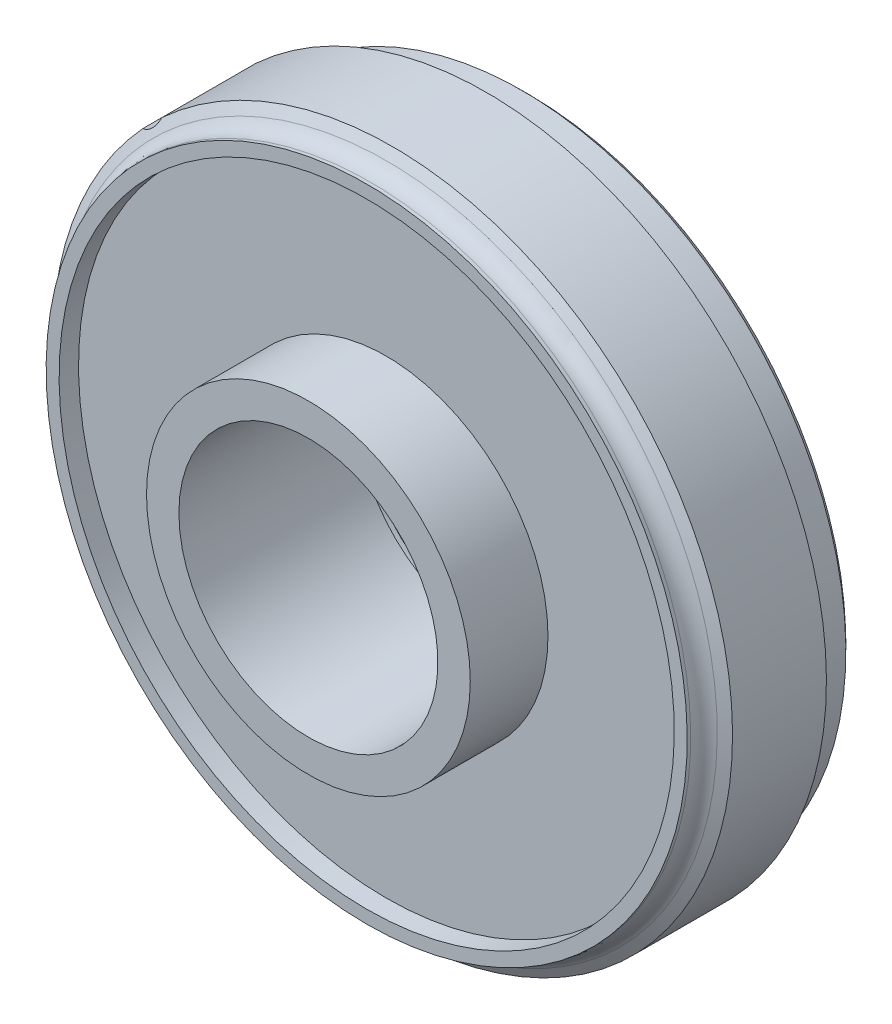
ISO-10303-21;
HEADER;
FILE_DESCRIPTION(('STEP AP214'),'2;1');
FILE_NAME('part.step','',(''),(''),'','','');
FILE_SCHEMA(('AUTOMOTIVE_DESIGN { 1 0 10303 214 1 1 1 1 }'));
ENDSEC;
DATA;
#1=APPLICATION_CONTEXT('core data for automotive mechanical design processes');
#2=APPLICATION_PROTOCOL_DEFINITION('international standard','automotive_design',2000,#1);
#3=PRODUCT_CONTEXT('',#1,'mechanical');
#4=PRODUCT('Part','Part','',(#3));
#5=PRODUCT_RELATED_PRODUCT_CATEGORY('part','',(#4));
#6=PRODUCT_DEFINITION_FORMATION('','',#4);
#7=PRODUCT_DEFINITION_CONTEXT('part definition',#1,'design');
#8=PRODUCT_DEFINITION('design','',#6,#7);
#9=PRODUCT_DEFINITION_SHAPE('','',#8);
#10=(LENGTH_UNIT() NAMED_UNIT(*) SI_UNIT(.MILLI.,.METRE.));
#11=(NAMED_UNIT(*) PLANE_ANGLE_UNIT() SI_UNIT($,.RADIAN.));
#12=(NAMED_UNIT(*) SI_UNIT($,.STERADIAN.) SOLID_ANGLE_UNIT());
#13=UNCERTAINTY_MEASURE_WITH_UNIT(LENGTH_MEASURE(1.E-05),#10,'distance_accuracy_value','');
#14=(GEOMETRIC_REPRESENTATION_CONTEXT(3) GLOBAL_UNCERTAINTY_ASSIGNED_CONTEXT((#13)) GLOBAL_UNIT_ASSIGNED_CONTEXT((#10,
#11,#12)) REPRESENTATION_CONTEXT('',''));
#15=CARTESIAN_POINT('',(0.,0.,0.));
#16=DIRECTION('',(0.,0.,1.));
#17=DIRECTION('',(1.,0.,0.));
#18=AXIS2_PLACEMENT_3D('',#15,#16,#17);
#19=CARTESIAN_POINT('',(50.,0.,-1119.25751655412));
#20=DIRECTION('',(0.,0.,1.));
#21=DIRECTION('',(0.,-1.,0.));
#22=AXIS2_PLACEMENT_3D('',#19,#20,#21);
#23=PLANE('',#22);
#24=CARTESIAN_POINT('',(2.97467828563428E-13,0.,-1119.25751655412));
#25=DIRECTION('',(0.,0.,1.));
#26=DIRECTION('',(0.,-1.,0.));
#27=AXIS2_PLACEMENT_3D('',#24,#25,#26);
#28=CIRCLE('',#27,50.);
#29=CARTESIAN_POINT('',(2.98985903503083E-13,-50.0000000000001,-1119.25751655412));
#30=VERTEX_POINT('',#29);
#31=EDGE_CURVE('E412',#30,#30,#28,.T.);
#32=ORIENTED_EDGE('',*,*,#31,.T.);
#33=EDGE_LOOP('',(#32));
#34=FACE_BOUND('',#33,.T.);
#35=CARTESIAN_POINT('',(-40.3050865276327,40.3050865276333,-1119.25751655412));
#36=DIRECTION('',(0.,0.,1.));
#37=DIRECTION('',(0.,-1.,0.));
#38=AXIS2_PLACEMENT_3D('',#35,#36,#37);
#39=CIRCLE('',#38,5.);
#40=CARTESIAN_POINT('',(-35.6149167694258,38.5723696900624,-1119.25751655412));
#41=VERTEX_POINT('',#40);
#42=CARTESIAN_POINT('',(-38.5723696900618,35.6149167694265,-1119.25751655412));
#43=VERTEX_POINT('',#42);
#44=EDGE_CURVE('E369',#41,#43,#39,.F.);
#45=ORIENTED_EDGE('',*,*,#44,.F.);
#46=CARTESIAN_POINT('',(2.97467828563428E-13,0.,-1119.25751655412));
#47=DIRECTION('',(0.,0.,1.));
#48=DIRECTION('',(0.,-1.,0.));
#49=AXIS2_PLACEMENT_3D('',#46,#47,#48);
#50=CIRCLE('',#49,52.5);
#51=CARTESIAN_POINT('',(-52.,-7.22841614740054,-1119.25751655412));
#52=VERTEX_POINT('',#51);
#53=EDGE_CURVE('E409',#52,#41,#50,.T.);
#54=ORIENTED_EDGE('',*,*,#53,.F.);
#55=DIRECTION('',(0.,1.,0.));
#56=VECTOR('',#55,1.);
#57=CARTESIAN_POINT('',(-52.,0.,-1119.25751655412));
#58=LINE('',#57,#56);
#59=CARTESIAN_POINT('',(-52.,7.22841614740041,-1119.25751655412));
#60=VERTEX_POINT('',#59);
#61=EDGE_CURVE('E377',#52,#60,#58,.T.);
#62=ORIENTED_EDGE('',*,*,#61,.T.);
#63=EDGE_CURVE('E408',#43,#60,#50,.T.);
#64=ORIENTED_EDGE('',*,*,#63,.F.);
#65=EDGE_LOOP('',(#45,#54,#62,#64));
#66=FACE_BOUND('',#65,.T.);
#67=ADVANCED_FACE('F16',(#34,#66),#23,.F.);
#68=CARTESIAN_POINT('',(2.9852247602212E-13,0.,-1100.25867694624));
#69=DIRECTION('',(0.,0.,1.));
#70=DIRECTION('',(0.,-1.,0.));
#71=AXIS2_PLACEMENT_3D('',#68,#69,#70);
#72=CYLINDRICAL_SURFACE('',#71,52.5);
#73=DIRECTION('',(0.,0.,-1.));
#74=VECTOR('',#73,1.);
#75=CARTESIAN_POINT('',(-38.5723696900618,35.6149167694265,-1109.75751655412));
#76=LINE('',#75,#74);
#77=CARTESIAN_POINT('',(-38.5723696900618,35.6149167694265,-1104.75751655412));
#78=VERTEX_POINT('',#77);
#79=EDGE_CURVE('E367',#43,#78,#76,.F.);
#80=ORIENTED_EDGE('',*,*,#79,.F.);
#81=ORIENTED_EDGE('',*,*,#63,.T.);
#82=DIRECTION('',(0.,0.,1.));
#83=VECTOR('',#82,1.);
#84=CARTESIAN_POINT('',(-52.,7.22841614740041,-1100.25867694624));
#85=LINE('',#84,#83);
#86=CARTESIAN_POINT('',(-52.,7.22841614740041,-1104.75751655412));
#87=VERTEX_POINT('',#86);
#88=EDGE_CURVE('E374',#60,#87,#85,.T.);
#89=ORIENTED_EDGE('',*,*,#88,.T.);
#90=CARTESIAN_POINT('',(2.98272740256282E-13,0.,-1104.75751655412));
#91=DIRECTION('',(0.,0.,1.));
#92=DIRECTION('',(0.,-1.,0.));
#93=AXIS2_PLACEMENT_3D('',#90,#91,#92);
#94=CIRCLE('',#93,52.5);
#95=EDGE_CURVE('E404',#78,#87,#94,.T.);
#96=ORIENTED_EDGE('',*,*,#95,.F.);
#97=EDGE_LOOP('',(#80,#81,#89,#96));
#98=FACE_BOUND('',#97,.T.);
#99=ADVANCED_FACE('F506',(#98),#72,.T.);
#100=DIRECTION('',(0.,0.,-1.));
#101=VECTOR('',#100,1.);
#102=CARTESIAN_POINT('',(-35.6149167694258,38.5723696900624,-1109.75751655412));
#103=LINE('',#102,#101);
#104=CARTESIAN_POINT('',(-35.6149167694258,38.5723696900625,-1104.75751655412));
#105=VERTEX_POINT('',#104);
#106=EDGE_CURVE('E365',#105,#41,#103,.T.);
#107=ORIENTED_EDGE('',*,*,#106,.F.);
#108=CARTESIAN_POINT('',(-52.,-7.22841614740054,-1104.75751655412));
#109=VERTEX_POINT('',#108);
#110=EDGE_CURVE('E405',#109,#105,#94,.T.);
#111=ORIENTED_EDGE('',*,*,#110,.F.);
#112=DIRECTION('',(0.,0.,1.));
#113=VECTOR('',#112,1.);
#114=CARTESIAN_POINT('',(-52.,-7.22841614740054,-1100.25867694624));
#115=LINE('',#114,#113);
#116=EDGE_CURVE('E371',#109,#52,#115,.F.);
#117=ORIENTED_EDGE('',*,*,#116,.T.);
#118=ORIENTED_EDGE('',*,*,#53,.T.);
#119=EDGE_LOOP('',(#107,#111,#117,#118));
#120=FACE_BOUND('',#119,.T.);
#121=ADVANCED_FACE('F513',(#120),#72,.T.);
#122=CARTESIAN_POINT('',(2.98272740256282E-13,0.,-1104.75751655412));
#123=DIRECTION('',(0.,0.,-1.));
#124=DIRECTION('',(0.,1.,0.));
#125=AXIS2_PLACEMENT_3D('',#122,#123,#124);
#126=CONICAL_SURFACE('',#125,52.5,1.0471975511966);
#127=CARTESIAN_POINT('',(2.98320814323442E-13,0.,-1103.89149115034));
#128=DIRECTION('',(0.,0.,1.));
#129=DIRECTION('',(0.,-1.,0.));
#130=AXIS2_PLACEMENT_3D('',#127,#128,#129);
#131=CIRCLE('',#130,51.);
#132=CARTESIAN_POINT('',(2.99869250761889E-13,-51.,-1103.89149115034));
#133=VERTEX_POINT('',#132);
#134=EDGE_CURVE('E401',#133,#133,#131,.T.);
#135=ORIENTED_EDGE('',*,*,#134,.F.);
#136=EDGE_LOOP('',(#135));
#137=FACE_BOUND('',#136,.T.);
#138=CARTESIAN_POINT('',(-38.5730851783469,35.6146525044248,-1104.75771655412));
#139=CARTESIAN_POINT('',(-38.4618477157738,35.6557125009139,-1104.72661065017));
#140=CARTESIAN_POINT('',(-38.3515149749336,35.7009660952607,-1104.697717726));
#141=CARTESIAN_POINT('',(-38.133395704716,35.799749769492,-1104.64467256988));
#142=CARTESIAN_POINT('',(-38.0256101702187,35.8532830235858,-1104.62052216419));
#143=CARTESIAN_POINT('',(-37.8135828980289,35.968389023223,-1104.57733665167));
#144=CARTESIAN_POINT('',(-37.7093356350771,36.0299484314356,-1104.55829321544));
#145=CARTESIAN_POINT('',(-37.5050185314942,36.1608933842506,-1104.52553872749));
#146=CARTESIAN_POINT('',(-37.404948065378,36.2302777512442,-1104.51182687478));
#147=CARTESIAN_POINT('',(-37.2094640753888,36.3767177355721,-1104.48990294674));
#148=CARTESIAN_POINT('',(-37.1140656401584,36.4537960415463,-1104.48170772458));
#149=CARTESIAN_POINT('',(-36.9289763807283,36.6149719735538,-1104.47100912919));
#150=CARTESIAN_POINT('',(-36.8392881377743,36.699072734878,-1104.46850831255));
#151=CARTESIAN_POINT('',(-36.6663704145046,36.8736381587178,-1104.46924566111));
#152=CARTESIAN_POINT('',(-36.5831405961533,36.9641024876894,-1104.47248352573));
#153=CARTESIAN_POINT('',(-36.4237776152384,37.1506478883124,-1104.48464379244));
#154=CARTESIAN_POINT('',(-36.3476412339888,37.2467263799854,-1104.49356360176));
#155=CARTESIAN_POINT('',(-36.205446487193,37.440323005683,-1104.51653820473));
#156=CARTESIAN_POINT('',(-36.1391291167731,37.5376738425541,-1104.53040290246));
#157=CARTESIAN_POINT('',(-36.0138551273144,37.7362123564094,-1104.56310409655));
#158=CARTESIAN_POINT('',(-35.9548992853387,37.8374004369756,-1104.58194111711));
#159=CARTESIAN_POINT('',(-35.8445220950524,38.0430099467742,-1104.62436811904));
#160=CARTESIAN_POINT('',(-35.7931107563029,38.1474354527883,-1104.64796431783));
#161=CARTESIAN_POINT('',(-35.6980440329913,38.3586535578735,-1104.69958970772));
#162=CARTESIAN_POINT('',(-35.6543861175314,38.4654453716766,-1104.72761744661));
#163=CARTESIAN_POINT('',(-35.6146525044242,38.5730851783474,-1104.75771655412));
#164=B_SPLINE_CURVE_WITH_KNOTS('',3,(#138,#139,#140,#141,#142,#143,#144,#145,#146,#147,#148,
#149,#150,#151,#152,#153,#154,#155,#156,#157,#158,#159,#160,#161,#162,#163),.UNSPECIFIED.,.F.,
.F.,(4,2,2,2,2,2,2,2,2,2,2,2,4),(0.,0.367696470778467,0.735534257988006,1.10276840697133,
1.46994736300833,1.83824301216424,2.20670398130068,2.57514565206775,2.94341931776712,
3.29883891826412,3.65429600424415,4.01022050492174,4.36602860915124),.UNSPECIFIED.);
#165=EDGE_CURVE('E424',#78,#105,#164,.T.);
#166=ORIENTED_EDGE('',*,*,#165,.F.);
#167=ORIENTED_EDGE('',*,*,#95,.T.);
#168=CARTESIAN_POINT('',(-52.,47.4038979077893,-1115.07145372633));
#169=CARTESIAN_POINT('',(-52.,46.5904251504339,-1114.75505962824));
#170=CARTESIAN_POINT('',(-52.,45.7754505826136,-1114.44250662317));
#171=CARTESIAN_POINT('',(-52.,44.1423064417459,-1113.8258136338));
#172=CARTESIAN_POINT('',(-52.,43.3241368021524,-1113.52167382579));
#173=CARTESIAN_POINT('',(-52.,41.6841691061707,-1112.92245050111));
#174=CARTESIAN_POINT('',(-52.,40.862369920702,-1112.62737006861));
#175=CARTESIAN_POINT('',(-52.,39.215255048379,-1112.04720617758));
#176=CARTESIAN_POINT('',(-52.,38.3899393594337,-1111.76212272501));
#177=CARTESIAN_POINT('',(-52.,35.8997870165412,-1110.92025267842));
#178=CARTESIAN_POINT('',(-52.,34.2293063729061,-1110.37999465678));
#179=CARTESIAN_POINT('',(-52.,30.8724543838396,-1109.35166609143));
#180=CARTESIAN_POINT('',(-52.,29.1860845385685,-1108.86359067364));
#181=CARTESIAN_POINT('',(-52.,25.8495835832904,-1107.96326539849));
#182=CARTESIAN_POINT('',(-52.,24.1999669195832,-1107.54912258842));
#183=CARTESIAN_POINT('',(-52.,20.8853803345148,-1106.78797214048));
#184=CARTESIAN_POINT('',(-52.,19.2204119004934,-1106.44095806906));
#185=CARTESIAN_POINT('',(-52.,15.8795872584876,-1105.82424093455));
#186=CARTESIAN_POINT('',(-52.,14.2037610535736,-1105.55437791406));
#187=CARTESIAN_POINT('',(-52.,11.6815749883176,-1105.21343942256));
#188=CARTESIAN_POINT('',(-52.,10.8394524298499,-1105.11043710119));
#189=CARTESIAN_POINT('',(-52.,9.15279110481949,-1104.92660947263));
#190=CARTESIAN_POINT('',(-52.,8.30825237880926,-1104.84578379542));
#191=CARTESIAN_POINT('',(-52.,6.28817827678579,-1104.6801081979));
#192=CARTESIAN_POINT('',(-52.,5.11174859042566,-1104.60593555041));
#193=CARTESIAN_POINT('',(-52.,2.75694043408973,-1104.50336440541));
#194=CARTESIAN_POINT('',(-52.,1.57856203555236,-1104.47496426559));
#195=CARTESIAN_POINT('',(-52.,-0.779311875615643,-1104.46449167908));
#196=CARTESIAN_POINT('',(-52.,-1.95880755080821,-1104.48245485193));
#197=CARTESIAN_POINT('',(-52.,-4.31618009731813,-1104.56442407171));
#198=CARTESIAN_POINT('',(-52.,-5.49405697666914,-1104.62842988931));
#199=CARTESIAN_POINT('',(-52.,-7.87142331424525,-1104.80306479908));
#200=CARTESIAN_POINT('',(-52.,-9.07084199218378,-1104.91465288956));
#201=CARTESIAN_POINT('',(-52.,-11.4647526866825,-1105.1823890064));
#202=CARTESIAN_POINT('',(-52.,-12.6592443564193,-1105.33854011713));
#203=CARTESIAN_POINT('',(-52.,-15.0409268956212,-1105.69246354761));
#204=CARTESIAN_POINT('',(-52.,-16.2281232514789,-1105.89019922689));
#205=CARTESIAN_POINT('',(-52.,-18.5952259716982,-1106.32410438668));
#206=CARTESIAN_POINT('',(-52.,-19.7751338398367,-1106.56026564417));
#207=CARTESIAN_POINT('',(-52.,-20.9511286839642,-1106.81404824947));
#208=B_SPLINE_CURVE_WITH_KNOTS('',3,(#168,#169,#170,#171,#172,#173,#174,#175,#176,#177,#178,
#179,#180,#181,#182,#183,#184,#185,#186,#187,#188,#189,#190,#191,#192,#193,#194,#195,#196,#197,
#198,#199,#200,#201,#202,#203,#204,#205,#206,#207),.UNSPECIFIED.,.F.,.F.,(4,2,2,2,2,2,2,2,2,2,2,
2,2,2,2,2,2,2,2,4),(0.,2.61850936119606,5.237073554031,7.85651954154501,10.4759670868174,
15.7422197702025,21.0079801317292,26.1091808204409,31.2098923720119,36.2999506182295,
38.8448960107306,41.3897989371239,44.9251913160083,48.4604568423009,51.9984392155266,
55.5364039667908,59.1493213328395,62.7624888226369,66.3724859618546,69.981711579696),.UNSPECIFIED.);
#209=EDGE_CURVE('E415',#87,#109,#208,.T.);
#210=ORIENTED_EDGE('',*,*,#209,.T.);
#211=ORIENTED_EDGE('',*,*,#110,.T.);
#212=EDGE_LOOP('',(#166,#167,#210,#211));
#213=FACE_BOUND('',#212,.T.);
#214=ADVANCED_FACE('F431',(#137,#213),#126,.T.);
#215=CARTESIAN_POINT('',(47.5,0.,-1103.75751655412));
#216=DIRECTION('',(0.,0.,-1.));
#217=DIRECTION('',(0.,1.,0.));
#218=AXIS2_PLACEMENT_3D('',#215,#216,#217);
#219=PLANE('',#218);
#220=CARTESIAN_POINT('',(2.98328251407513E-13,0.,-1103.75751655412));
#221=DIRECTION('',(0.,0.,1.));
#222=DIRECTION('',(1.,0.,0.));
#223=AXIS2_PLACEMENT_3D('',#220,#221,#222);
#224=CIRCLE('',#223,47.5);
#225=CARTESIAN_POINT('',(47.5000000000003,0.,-1103.75751655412));
#226=VERTEX_POINT('',#225);
#227=EDGE_CURVE('E1177',#226,#226,#224,.T.);
#228=ORIENTED_EDGE('',*,*,#227,.T.);
#229=EDGE_LOOP('',(#228));
#230=FACE_BOUND('',#229,.T.);
#231=CARTESIAN_POINT('',(2.98328251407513E-13,0.,-1103.75751655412));
#232=DIRECTION('',(0.,0.,-1.));
#233=DIRECTION('',(-1.,0.,0.));
#234=AXIS2_PLACEMENT_3D('',#231,#232,#233);
#235=CIRCLE('',#234,25.);
#236=CARTESIAN_POINT('',(-24.9999999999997,0.,-1103.75751655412));
#237=VERTEX_POINT('',#236);
#238=EDGE_CURVE('E206',#237,#237,#235,.T.);
#239=ORIENTED_EDGE('',*,*,#238,.T.);
#240=EDGE_LOOP('',(#239));
#241=FACE_BOUND('',#240,.T.);
#242=ADVANCED_FACE('F478',(#230,#241),#219,.F.);
#243=CARTESIAN_POINT('',(2.9852247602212E-13,0.,-1100.25867694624));
#244=DIRECTION('',(0.,0.,1.));
#245=DIRECTION('',(0.,-1.,0.));
#246=AXIS2_PLACEMENT_3D('',#243,#244,#245);
#247=CYLINDRICAL_SURFACE('',#246,50.);
#248=CARTESIAN_POINT('',(2.97162517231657E-13,0.,-1124.75751655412));
#249=DIRECTION('',(0.,0.,1.));
#250=DIRECTION('',(0.,-1.,0.));
#251=AXIS2_PLACEMENT_3D('',#248,#249,#250);
#252=CIRCLE('',#251,50.);
#253=CARTESIAN_POINT('',(2.98680592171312E-13,-50.0000000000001,-1124.75751655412));
#254=VERTEX_POINT('',#253);
#255=EDGE_CURVE('E563',#254,#254,#252,.T.);
#256=ORIENTED_EDGE('',*,*,#255,.T.);
#257=EDGE_LOOP('',(#256));
#258=FACE_BOUND('',#257,.T.);
#259=ORIENTED_EDGE('',*,*,#31,.F.);
#260=EDGE_LOOP('',(#259));
#261=FACE_BOUND('',#260,.T.);
#262=ADVANCED_FACE('F481',(#258,#261),#247,.T.);
#263=CARTESIAN_POINT('',(2.98465036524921E-13,0.,-1101.29341493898));
#264=DIRECTION('',(0.,0.,1.));
#265=DIRECTION('',(0.,-1.,0.));
#266=AXIS2_PLACEMENT_3D('',#263,#264,#265);
#267=TOROIDAL_SURFACE('',#266,52.5,3.);
#268=CARTESIAN_POINT('',(2.98465036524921E-13,0.,-1101.29341493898));
#269=DIRECTION('',(0.,0.,1.));
#270=DIRECTION('',(0.,-1.,0.));
#271=AXIS2_PLACEMENT_3D('',#268,#269,#270);
#272=CIRCLE('',#271,49.5);
#273=CARTESIAN_POINT('',(2.99967930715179E-13,-49.5000000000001,-1101.29341493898));
#274=VERTEX_POINT('',#273);
#275=EDGE_CURVE('E398',#274,#274,#272,.T.);
#276=ORIENTED_EDGE('',*,*,#275,.F.);
#277=EDGE_LOOP('',(#276));
#278=FACE_BOUND('',#277,.T.);
#279=ORIENTED_EDGE('',*,*,#134,.T.);
#280=EDGE_LOOP('',(#279));
#281=FACE_BOUND('',#280,.T.);
#282=ADVANCED_FACE('F492',(#278,#281),#267,.F.);
#283=CARTESIAN_POINT('',(2.9852247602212E-13,0.,-1100.25867694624));
#284=DIRECTION('',(0.,0.,1.));
#285=DIRECTION('',(0.,-1.,0.));
#286=AXIS2_PLACEMENT_3D('',#283,#284,#285);
#287=CYLINDRICAL_SURFACE('',#286,49.5);
#288=CARTESIAN_POINT('',(2.98494784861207E-13,0.,-1100.75751655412));
#289=DIRECTION('',(0.,0.,1.));
#290=DIRECTION('',(0.,-1.,0.));
#291=AXIS2_PLACEMENT_3D('',#288,#289,#290);
#292=CIRCLE('',#291,49.5);
#293=CARTESIAN_POINT('',(2.99997679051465E-13,-49.5000000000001,-1100.75751655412));
#294=VERTEX_POINT('',#293);
#295=EDGE_CURVE('E395',#294,#294,#292,.T.);
#296=ORIENTED_EDGE('',*,*,#295,.F.);
#297=EDGE_LOOP('',(#296));
#298=FACE_BOUND('',#297,.T.);
#299=ORIENTED_EDGE('',*,*,#275,.T.);
#300=EDGE_LOOP('',(#299));
#301=FACE_BOUND('',#300,.T.);
#302=ADVANCED_FACE('F489',(#298,#301),#287,.T.);
#303=CARTESIAN_POINT('',(47.5,0.,-1100.75751655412));
#304=DIRECTION('',(0.,0.,-1.));
#305=DIRECTION('',(0.,1.,0.));
#306=AXIS2_PLACEMENT_3D('',#303,#304,#305);
#307=PLANE('',#306);
#308=CARTESIAN_POINT('',(2.98494784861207E-13,0.,-1100.75751655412));
#309=DIRECTION('',(0.,0.,1.));
#310=DIRECTION('',(0.,-1.,0.));
#311=AXIS2_PLACEMENT_3D('',#308,#309,#310);
#312=CIRCLE('',#311,47.5);
#313=CARTESIAN_POINT('',(2.99936956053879E-13,-47.5000000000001,-1100.75751655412));
#314=VERTEX_POINT('',#313);
#315=EDGE_CURVE('E392',#314,#314,#312,.T.);
#316=ORIENTED_EDGE('',*,*,#315,.F.);
#317=EDGE_LOOP('',(#316));
#318=FACE_BOUND('',#317,.T.);
#319=ORIENTED_EDGE('',*,*,#295,.T.);
#320=EDGE_LOOP('',(#319));
#321=FACE_BOUND('',#320,.T.);
#322=ADVANCED_FACE('F485',(#318,#321),#307,.F.);
#323=CARTESIAN_POINT('',(2.9852247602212E-13,0.,-1100.25867694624));
#324=DIRECTION('',(0.,0.,1.));
#325=DIRECTION('',(0.,-1.,0.));
#326=AXIS2_PLACEMENT_3D('',#323,#324,#325);
#327=CYLINDRICAL_SURFACE('',#326,47.5);
#328=ORIENTED_EDGE('',*,*,#315,.T.);
#329=EDGE_LOOP('',(#328));
#330=FACE_BOUND('',#329,.T.);
#331=ORIENTED_EDGE('',*,*,#227,.F.);
#332=EDGE_LOOP('',(#331));
#333=FACE_BOUND('',#332,.T.);
#334=ADVANCED_FACE('F470',(#330,#333),#327,.F.);
#335=CARTESIAN_POINT('',(27.5,0.,-1119.25751655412));
#336=DIRECTION('',(0.,0.,1.));
#337=DIRECTION('',(0.,-1.,0.));
#338=AXIS2_PLACEMENT_3D('',#335,#336,#337);
#339=PLANE('',#338);
#340=CARTESIAN_POINT('',(2.97467828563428E-13,0.,-1119.25751655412));
#341=DIRECTION('',(0.,0.,1.));
#342=DIRECTION('',(0.,-1.,0.));
#343=AXIS2_PLACEMENT_3D('',#340,#341,#342);
#344=CIRCLE('',#343,27.5);
#345=CARTESIAN_POINT('',(2.98302769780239E-13,-27.5000000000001,-1119.25751655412));
#346=VERTEX_POINT('',#345);
#347=EDGE_CURVE('E389',#346,#346,#344,.T.);
#348=ORIENTED_EDGE('',*,*,#347,.F.);
#349=EDGE_LOOP('',(#348));
#350=FACE_BOUND('',#349,.T.);
#351=CARTESIAN_POINT('',(2.97467828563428E-13,0.,-1119.25751655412));
#352=DIRECTION('',(0.,0.,-1.));
#353=DIRECTION('',(-1.,0.,0.));
#354=AXIS2_PLACEMENT_3D('',#351,#352,#353);
#355=CIRCLE('',#354,20.);
#356=CARTESIAN_POINT('',(-19.9999999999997,0.,-1119.25751655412));
#357=VERTEX_POINT('',#356);
#358=EDGE_CURVE('E1182',#357,#357,#355,.T.);
#359=ORIENTED_EDGE('',*,*,#358,.F.);
#360=EDGE_LOOP('',(#359));
#361=FACE_BOUND('',#360,.T.);
#362=ADVANCED_FACE('F466',(#350,#361),#339,.F.);
#363=CARTESIAN_POINT('',(2.9852247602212E-13,0.,-1100.25867694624));
#364=DIRECTION('',(0.,0.,1.));
#365=DIRECTION('',(0.,-1.,0.));
#366=AXIS2_PLACEMENT_3D('',#363,#364,#365);
#367=CYLINDRICAL_SURFACE('',#366,27.5);
#368=CARTESIAN_POINT('',(2.97134761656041E-13,0.,-1125.25751655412));
#369=DIRECTION('',(0.,0.,1.));
#370=DIRECTION('',(0.,-1.,0.));
#371=AXIS2_PLACEMENT_3D('',#368,#369,#370);
#372=CIRCLE('',#371,27.5);
#373=CARTESIAN_POINT('',(2.97969702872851E-13,-27.5000000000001,-1125.25751655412));
#374=VERTEX_POINT('',#373);
#375=EDGE_CURVE('E609',#374,#374,#372,.F.);
#376=ORIENTED_EDGE('',*,*,#375,.T.);
#377=EDGE_LOOP('',(#376));
#378=FACE_BOUND('',#377,.T.);
#379=ORIENTED_EDGE('',*,*,#347,.T.);
#380=EDGE_LOOP('',(#379));
#381=FACE_BOUND('',#380,.T.);
#382=ADVANCED_FACE('F462',(#378,#381),#367,.F.);
#383=CARTESIAN_POINT('',(50.,0.,-1125.75751655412));
#384=DIRECTION('',(0.,0.,1.));
#385=DIRECTION('',(0.,-1.,0.));
#386=AXIS2_PLACEMENT_3D('',#383,#384,#385);
#387=PLANE('',#386);
#388=CARTESIAN_POINT('',(2.97107006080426E-13,0.,-1125.75751655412));
#389=DIRECTION('',(0.,0.,1.));
#390=DIRECTION('',(1.,0.,0.));
#391=AXIS2_PLACEMENT_3D('',#388,#389,#390);
#392=CIRCLE('',#391,37.);
#393=CARTESIAN_POINT('',(-36.1914612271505,7.69273256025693,-1125.75751655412));
#394=VERTEX_POINT('',#393);
#395=CARTESIAN_POINT('',(-36.1914612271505,-7.69273256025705,-1125.75751655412));
#396=VERTEX_POINT('',#395);
#397=EDGE_CURVE('E212',#394,#396,#392,.T.);
#398=ORIENTED_EDGE('',*,*,#397,.F.);
#399=CARTESIAN_POINT('',(-41.0821992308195,8.73229101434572,-1125.75751655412));
#400=DIRECTION('',(0.,0.,-1.));
#401=DIRECTION('',(1.,0.,0.));
#402=AXIS2_PLACEMENT_3D('',#399,#400,#401);
#403=CIRCLE('',#402,5.);
#404=CARTESIAN_POINT('',(-45.9729372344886,9.7718494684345,-1125.75751655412));
#405=VERTEX_POINT('',#404);
#406=EDGE_CURVE('E31',#405,#394,#403,.T.);
#407=ORIENTED_EDGE('',*,*,#406,.F.);
#408=CARTESIAN_POINT('',(2.97107006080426E-13,0.,-1125.75751655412));
#409=DIRECTION('',(0.,0.,-1.));
#410=DIRECTION('',(1.,0.,0.));
#411=AXIS2_PLACEMENT_3D('',#408,#409,#410);
#412=CIRCLE('',#411,47.);
#413=CARTESIAN_POINT('',(-45.9729372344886,-9.77184946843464,-1125.75751655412));
#414=VERTEX_POINT('',#413);
#415=EDGE_CURVE('E200',#414,#405,#412,.T.);
#416=ORIENTED_EDGE('',*,*,#415,.F.);
#417=CARTESIAN_POINT('',(-41.0821992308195,-8.73229101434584,-1125.75751655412));
#418=DIRECTION('',(0.,0.,-1.));
#419=DIRECTION('',(1.,0.,0.));
#420=AXIS2_PLACEMENT_3D('',#417,#418,#419);
#421=CIRCLE('',#420,5.);
#422=EDGE_CURVE('E203',#396,#414,#421,.T.);
#423=ORIENTED_EDGE('',*,*,#422,.F.);
#424=EDGE_LOOP('',(#398,#407,#416,#423));
#425=FACE_BOUND('',#424,.T.);
#426=CARTESIAN_POINT('',(2.97107006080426E-13,0.,-1125.75751655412));
#427=DIRECTION('',(0.,0.,1.));
#428=DIRECTION('',(-0.499999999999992,0.866025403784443,0.));
#429=AXIS2_PLACEMENT_3D('',#426,#427,#428);
#430=CIRCLE('',#429,37.);
#431=CARTESIAN_POINT('',(24.7578324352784,27.4963585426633,-1125.75751655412));
#432=VERTEX_POINT('',#431);
#433=CARTESIAN_POINT('',(11.4336287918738,35.1890911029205,-1125.75751655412));
#434=VERTEX_POINT('',#433);
#435=EDGE_CURVE('E236',#432,#434,#430,.T.);
#436=ORIENTED_EDGE('',*,*,#435,.F.);
#437=CARTESIAN_POINT('',(28.1034854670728,31.2120826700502,-1125.75751655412));
#438=DIRECTION('',(0.,0.,-1.));
#439=DIRECTION('',(-0.499999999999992,0.866025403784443,0.));
#440=AXIS2_PLACEMENT_3D('',#437,#438,#439);
#441=CIRCLE('',#440,5.);
#442=CARTESIAN_POINT('',(31.4491384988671,34.9278067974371,-1125.75751655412));
#443=VERTEX_POINT('',#442);
#444=EDGE_CURVE('E39',#443,#432,#441,.T.);
#445=ORIENTED_EDGE('',*,*,#444,.F.);
#446=CARTESIAN_POINT('',(2.97107006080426E-13,0.,-1125.75751655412));
#447=DIRECTION('',(0.,0.,-1.));
#448=DIRECTION('',(-0.499999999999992,0.866025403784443,0.));
#449=AXIS2_PLACEMENT_3D('',#446,#447,#448);
#450=CIRCLE('',#449,47.);
#451=CARTESIAN_POINT('',(14.5237987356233,44.699656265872,-1125.75751655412));
#452=VERTEX_POINT('',#451);
#453=EDGE_CURVE('E225',#452,#443,#450,.T.);
#454=ORIENTED_EDGE('',*,*,#453,.F.);
#455=CARTESIAN_POINT('',(12.9787137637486,39.9443736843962,-1125.75751655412));
#456=DIRECTION('',(0.,0.,-1.));
#457=DIRECTION('',(-0.499999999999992,0.866025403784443,0.));
#458=AXIS2_PLACEMENT_3D('',#455,#456,#457);
#459=CIRCLE('',#458,5.);
#460=EDGE_CURVE('E239',#434,#452,#459,.T.);
#461=ORIENTED_EDGE('',*,*,#460,.F.);
#462=EDGE_LOOP('',(#436,#445,#454,#461));
#463=FACE_BOUND('',#462,.T.);
#464=CARTESIAN_POINT('',(2.97107006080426E-13,0.,-1125.75751655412));
#465=DIRECTION('',(0.,0.,1.));
#466=DIRECTION('',(-1.,0.,0.));
#467=AXIS2_PLACEMENT_3D('',#464,#465,#466);
#468=CIRCLE('',#467,37.);
#469=CARTESIAN_POINT('',(-11.4336287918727,35.1890911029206,-1125.75751655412));
#470=VERTEX_POINT('',#469);
#471=CARTESIAN_POINT('',(-24.7578324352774,27.4963585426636,-1125.75751655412));
#472=VERTEX_POINT('',#471);
#473=EDGE_CURVE('E267',#470,#472,#468,.T.);
#474=ORIENTED_EDGE('',*,*,#473,.F.);
#475=CARTESIAN_POINT('',(-12.9787137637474,39.9443736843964,-1125.75751655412));
#476=DIRECTION('',(0.,0.,-1.));
#477=DIRECTION('',(-1.,0.,0.));
#478=AXIS2_PLACEMENT_3D('',#475,#476,#477);
#479=CIRCLE('',#478,5.);
#480=CARTESIAN_POINT('',(-14.5237987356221,44.6996562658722,-1125.75751655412));
#481=VERTEX_POINT('',#480);
#482=EDGE_CURVE('E246',#481,#470,#479,.T.);
#483=ORIENTED_EDGE('',*,*,#482,.F.);
#484=CARTESIAN_POINT('',(2.97107006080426E-13,0.,-1125.75751655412));
#485=DIRECTION('',(0.,0.,-1.));
#486=DIRECTION('',(-1.,0.,0.));
#487=AXIS2_PLACEMENT_3D('',#484,#485,#486);
#488=CIRCLE('',#487,47.);
#489=CARTESIAN_POINT('',(-31.4491384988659,34.9278067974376,-1125.75751655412));
#490=VERTEX_POINT('',#489);
#491=EDGE_CURVE('E256',#490,#481,#488,.T.);
#492=ORIENTED_EDGE('',*,*,#491,.F.);
#493=CARTESIAN_POINT('',(-28.1034854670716,31.2120826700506,-1125.75751655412));
#494=DIRECTION('',(0.,0.,-1.));
#495=DIRECTION('',(-1.,0.,0.));
#496=AXIS2_PLACEMENT_3D('',#493,#494,#495);
#497=CIRCLE('',#496,5.);
#498=EDGE_CURVE('E270',#472,#490,#497,.T.);
#499=ORIENTED_EDGE('',*,*,#498,.F.);
#500=EDGE_LOOP('',(#474,#483,#492,#499));
#501=FACE_BOUND('',#500,.T.);
#502=CARTESIAN_POINT('',(2.97107006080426E-13,0.,-1125.75751655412));
#503=DIRECTION('',(0.,0.,1.));
#504=DIRECTION('',(0.5,-0.86602540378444,0.));
#505=AXIS2_PLACEMENT_3D('',#502,#503,#504);
#506=CIRCLE('',#505,37.);
#507=CARTESIAN_POINT('',(-24.7578324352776,-27.4963585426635,-1125.75751655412));
#508=VERTEX_POINT('',#507);
#509=CARTESIAN_POINT('',(-11.4336287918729,-35.1890911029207,-1125.75751655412));
#510=VERTEX_POINT('',#509);
#511=EDGE_CURVE('E299',#508,#510,#506,.T.);
#512=ORIENTED_EDGE('',*,*,#511,.F.);
#513=CARTESIAN_POINT('',(-28.1034854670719,-31.2120826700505,-1125.75751655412));
#514=DIRECTION('',(0.,0.,-1.));
#515=DIRECTION('',(0.5,-0.86602540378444,0.));
#516=AXIS2_PLACEMENT_3D('',#513,#514,#515);
#517=CIRCLE('',#516,5.);
#518=CARTESIAN_POINT('',(-31.4491384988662,-34.9278067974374,-1125.75751655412));
#519=VERTEX_POINT('',#518);
#520=EDGE_CURVE('E277',#519,#508,#517,.T.);
#521=ORIENTED_EDGE('',*,*,#520,.F.);
#522=CARTESIAN_POINT('',(2.97107006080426E-13,0.,-1125.75751655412));
#523=DIRECTION('',(0.,0.,-1.));
#524=DIRECTION('',(0.5,-0.86602540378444,0.));
#525=AXIS2_PLACEMENT_3D('',#522,#523,#524);
#526=CIRCLE('',#525,47.);
#527=CARTESIAN_POINT('',(-14.5237987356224,-44.6996562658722,-1125.75751655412));
#528=VERTEX_POINT('',#527);
#529=EDGE_CURVE('E288',#528,#519,#526,.T.);
#530=ORIENTED_EDGE('',*,*,#529,.F.);
#531=CARTESIAN_POINT('',(-12.9787137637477,-39.9443736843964,-1125.75751655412));
#532=DIRECTION('',(0.,0.,-1.));
#533=DIRECTION('',(0.5,-0.86602540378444,0.));
#534=AXIS2_PLACEMENT_3D('',#531,#532,#533);
#535=CIRCLE('',#534,5.);
#536=EDGE_CURVE('E302',#510,#528,#535,.T.);
#537=ORIENTED_EDGE('',*,*,#536,.F.);
#538=EDGE_LOOP('',(#512,#521,#530,#537));
#539=FACE_BOUND('',#538,.T.);
#540=CARTESIAN_POINT('',(2.97107006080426E-13,0.,-1125.75751655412));
#541=DIRECTION('',(0.,0.,1.));
#542=DIRECTION('',(1.,0.,0.));
#543=AXIS2_PLACEMENT_3D('',#540,#541,#542);
#544=CIRCLE('',#543,37.);
#545=CARTESIAN_POINT('',(11.4336287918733,-35.1890911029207,-1125.75751655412));
#546=VERTEX_POINT('',#545);
#547=CARTESIAN_POINT('',(24.757832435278,-27.4963585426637,-1125.75751655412));
#548=VERTEX_POINT('',#547);
#549=EDGE_CURVE('E331',#546,#548,#544,.T.);
#550=ORIENTED_EDGE('',*,*,#549,.F.);
#551=CARTESIAN_POINT('',(12.978713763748,-39.9443736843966,-1125.75751655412));
#552=DIRECTION('',(0.,0.,-1.));
#553=DIRECTION('',(1.,0.,0.));
#554=AXIS2_PLACEMENT_3D('',#551,#552,#553);
#555=CIRCLE('',#554,5.);
#556=CARTESIAN_POINT('',(14.5237987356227,-44.6996562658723,-1125.75751655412));
#557=VERTEX_POINT('',#556);
#558=EDGE_CURVE('E309',#557,#546,#555,.T.);
#559=ORIENTED_EDGE('',*,*,#558,.F.);
#560=CARTESIAN_POINT('',(2.97107006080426E-13,0.,-1125.75751655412));
#561=DIRECTION('',(0.,0.,-1.));
#562=DIRECTION('',(1.,0.,0.));
#563=AXIS2_PLACEMENT_3D('',#560,#561,#562);
#564=CIRCLE('',#563,47.);
#565=CARTESIAN_POINT('',(31.4491384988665,-34.9278067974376,-1125.75751655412));
#566=VERTEX_POINT('',#565);
#567=EDGE_CURVE('E320',#566,#557,#564,.T.);
#568=ORIENTED_EDGE('',*,*,#567,.F.);
#569=CARTESIAN_POINT('',(28.1034854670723,-31.2120826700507,-1125.75751655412));
#570=DIRECTION('',(0.,0.,-1.));
#571=DIRECTION('',(1.,0.,0.));
#572=AXIS2_PLACEMENT_3D('',#569,#570,#571);
#573=CIRCLE('',#572,5.);
#574=EDGE_CURVE('E334',#548,#566,#573,.T.);
#575=ORIENTED_EDGE('',*,*,#574,.F.);
#576=EDGE_LOOP('',(#550,#559,#568,#575));
#577=FACE_BOUND('',#576,.T.);
#578=CARTESIAN_POINT('',(40.,0.,-1125.75751655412));
#579=DIRECTION('',(0.,0.,1.));
#580=DIRECTION('',(0.,-1.,0.));
#581=AXIS2_PLACEMENT_3D('',#578,#579,#580);
#582=CIRCLE('',#581,5.);
#583=CARTESIAN_POINT('',(40.,-5.00000000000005,-1125.75751655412));
#584=VERTEX_POINT('',#583);
#585=EDGE_CURVE('E10',#584,#584,#582,.T.);
#586=ORIENTED_EDGE('',*,*,#585,.T.);
#587=EDGE_LOOP('',(#586));
#588=FACE_BOUND('',#587,.T.);
#589=CARTESIAN_POINT('',(2.97107006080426E-13,0.,-1125.75751655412));
#590=DIRECTION('',(0.,0.,1.));
#591=DIRECTION('',(0.,-1.,0.));
#592=AXIS2_PLACEMENT_3D('',#589,#590,#591);
#593=CIRCLE('',#592,49.);
#594=CARTESIAN_POINT('',(2.98594719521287E-13,-49.0000000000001,-1125.75751655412));
#595=VERTEX_POINT('',#594);
#596=EDGE_CURVE('E560',#595,#595,#593,.F.);
#597=ORIENTED_EDGE('',*,*,#596,.T.);
#598=EDGE_LOOP('',(#597));
#599=FACE_BOUND('',#598,.T.);
#600=CARTESIAN_POINT('',(-34.6410161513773,-20.,-1125.75751655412));
#601=DIRECTION('',(0.,0.,1.));
#602=DIRECTION('',(0.,-1.,0.));
#603=AXIS2_PLACEMENT_3D('',#600,#601,#602);
#604=CIRCLE('',#603,4.4999999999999);
#605=CARTESIAN_POINT('',(-34.6410161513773,-24.4999999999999,-1125.75751655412));
#606=VERTEX_POINT('',#605);
#607=EDGE_CURVE('E564',#606,#606,#604,.T.);
#608=ORIENTED_EDGE('',*,*,#607,.T.);
#609=EDGE_LOOP('',(#608));
#610=FACE_BOUND('',#609,.T.);
#611=CARTESIAN_POINT('',(1.4566580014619E-13,-40.,-1125.75751655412));
#612=DIRECTION('',(0.,0.,1.));
#613=DIRECTION('',(0.,-1.,0.));
#614=AXIS2_PLACEMENT_3D('',#611,#612,#613);
#615=CIRCLE('',#614,4.5);
#616=CARTESIAN_POINT('',(1.45802426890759E-13,-44.5,-1125.75751655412));
#617=VERTEX_POINT('',#616);
#618=EDGE_CURVE('E579',#617,#617,#615,.T.);
#619=ORIENTED_EDGE('',*,*,#618,.T.);
#620=EDGE_LOOP('',(#619));
#621=FACE_BOUND('',#620,.T.);
#622=CARTESIAN_POINT('',(34.6410161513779,-20.,-1125.75751655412));
#623=DIRECTION('',(0.,0.,1.));
#624=DIRECTION('',(0.,-1.,0.));
#625=AXIS2_PLACEMENT_3D('',#622,#623,#624);
#626=CIRCLE('',#625,4.5);
#627=CARTESIAN_POINT('',(34.6410161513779,-24.5,-1125.75751655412));
#628=VERTEX_POINT('',#627);
#629=EDGE_CURVE('E585',#628,#628,#626,.T.);
#630=ORIENTED_EDGE('',*,*,#629,.T.);
#631=EDGE_LOOP('',(#630));
#632=FACE_BOUND('',#631,.T.);
#633=CARTESIAN_POINT('',(34.6410161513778,20.,-1125.75751655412));
#634=DIRECTION('',(0.,0.,1.));
#635=DIRECTION('',(0.,-1.,0.));
#636=AXIS2_PLACEMENT_3D('',#633,#634,#635);
#637=CIRCLE('',#636,4.5);
#638=CARTESIAN_POINT('',(34.6410161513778,15.5,-1125.75751655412));
#639=VERTEX_POINT('',#638);
#640=EDGE_CURVE('E591',#639,#639,#637,.T.);
#641=ORIENTED_EDGE('',*,*,#640,.T.);
#642=EDGE_LOOP('',(#641));
#643=FACE_BOUND('',#642,.T.);
#644=CARTESIAN_POINT('',(1.70992455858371E-13,40.,-1125.75751655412));
#645=DIRECTION('',(0.,0.,1.));
#646=DIRECTION('',(0.,-1.,0.));
#647=AXIS2_PLACEMENT_3D('',#644,#645,#646);
#648=CIRCLE('',#647,4.5);
#649=CARTESIAN_POINT('',(1.7112908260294E-13,35.5,-1125.75751655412));
#650=VERTEX_POINT('',#649);
#651=EDGE_CURVE('E597',#650,#650,#648,.T.);
#652=ORIENTED_EDGE('',*,*,#651,.T.);
#653=EDGE_LOOP('',(#652));
#654=FACE_BOUND('',#653,.T.);
#655=CARTESIAN_POINT('',(-34.6410161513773,20.,-1125.75751655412));
#656=DIRECTION('',(0.,0.,1.));
#657=DIRECTION('',(0.,-1.,0.));
#658=AXIS2_PLACEMENT_3D('',#655,#656,#657);
#659=CIRCLE('',#658,4.5);
#660=CARTESIAN_POINT('',(-34.6410161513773,15.5,-1125.75751655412));
#661=VERTEX_POINT('',#660);
#662=EDGE_CURVE('E603',#661,#661,#659,.T.);
#663=ORIENTED_EDGE('',*,*,#662,.T.);
#664=EDGE_LOOP('',(#663));
#665=FACE_BOUND('',#664,.T.);
#666=CARTESIAN_POINT('',(2.97107006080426E-13,0.,-1125.75751655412));
#667=DIRECTION('',(0.,0.,1.));
#668=DIRECTION('',(0.,-1.,0.));
#669=AXIS2_PLACEMENT_3D('',#666,#667,#668);
#670=CIRCLE('',#669,28.);
#671=CARTESIAN_POINT('',(2.97957128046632E-13,-28.0000000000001,-1125.75751655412));
#672=VERTEX_POINT('',#671);
#673=EDGE_CURVE('E611',#672,#672,#670,.T.);
#674=ORIENTED_EDGE('',*,*,#673,.T.);
#675=EDGE_LOOP('',(#674));
#676=FACE_BOUND('',#675,.T.);
#677=ADVANCED_FACE('F458',(#425,#463,#501,#539,#577,#588,#599,#610,#621,#632,#643,#654,#665,
#676),#387,.F.);
#678=CARTESIAN_POINT('',(40.,0.,-1111.75751655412));
#679=DIRECTION('',(0.,0.,-1.));
#680=DIRECTION('',(0.,1.,0.));
#681=AXIS2_PLACEMENT_3D('',#678,#679,#680);
#682=CONICAL_SURFACE('',#681,3.8,1.02974425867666);
#683=CARTESIAN_POINT('',(40.,0.,-1109.47424620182));
#684=VERTEX_POINT('',#683);
#685=VERTEX_LOOP('',#684);
#686=FACE_BOUND('',#685,.T.);
#687=CARTESIAN_POINT('',(40.,0.,-1111.75751655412));
#688=DIRECTION('',(0.,0.,-1.));
#689=DIRECTION('',(0.,1.,0.));
#690=AXIS2_PLACEMENT_3D('',#687,#688,#689);
#691=CIRCLE('',#690,3.8);
#692=CARTESIAN_POINT('',(40.,3.79999999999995,-1111.75751655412));
#693=VERTEX_POINT('',#692);
#694=EDGE_CURVE('E386',#693,#693,#691,.T.);
#695=ORIENTED_EDGE('',*,*,#694,.T.);
#696=EDGE_LOOP('',(#695));
#697=FACE_BOUND('',#696,.T.);
#698=ADVANCED_FACE('F454',(#686,#697),#682,.F.);
#699=CARTESIAN_POINT('',(40.,0.,-1125.75751655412));
#700=DIRECTION('',(0.,0.,-1.));
#701=DIRECTION('',(0.,1.,0.));
#702=AXIS2_PLACEMENT_3D('',#699,#700,#701);
#703=CYLINDRICAL_SURFACE('',#702,3.8);
#704=ORIENTED_EDGE('',*,*,#694,.F.);
#705=EDGE_LOOP('',(#704));
#706=FACE_BOUND('',#705,.T.);
#707=CARTESIAN_POINT('',(40.,0.,-1116.75751655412));
#708=DIRECTION('',(0.,0.,-1.));
#709=DIRECTION('',(0.,1.,0.));
#710=AXIS2_PLACEMENT_3D('',#707,#708,#709);
#711=CIRCLE('',#710,3.8);
#712=CARTESIAN_POINT('',(40.,3.79999999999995,-1116.75751655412));
#713=VERTEX_POINT('',#712);
#714=EDGE_CURVE('E383',#713,#713,#711,.T.);
#715=ORIENTED_EDGE('',*,*,#714,.T.);
#716=EDGE_LOOP('',(#715));
#717=FACE_BOUND('',#716,.T.);
#718=ADVANCED_FACE('F450',(#706,#717),#703,.F.);
#719=CARTESIAN_POINT('',(43.8,0.,-1116.75751655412));
#720=DIRECTION('',(0.,0.,1.));
#721=DIRECTION('',(0.,-1.,0.));
#722=AXIS2_PLACEMENT_3D('',#719,#720,#721);
#723=PLANE('',#722);
#724=ORIENTED_EDGE('',*,*,#714,.F.);
#725=EDGE_LOOP('',(#724));
#726=FACE_BOUND('',#725,.T.);
#727=CARTESIAN_POINT('',(40.,0.,-1116.75751655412));
#728=DIRECTION('',(0.,0.,-1.));
#729=DIRECTION('',(0.,1.,0.));
#730=AXIS2_PLACEMENT_3D('',#727,#728,#729);
#731=CIRCLE('',#730,4.);
#732=CARTESIAN_POINT('',(40.,3.99999999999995,-1116.75751655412));
#733=VERTEX_POINT('',#732);
#734=EDGE_CURVE('E380',#733,#733,#731,.T.);
#735=ORIENTED_EDGE('',*,*,#734,.T.);
#736=EDGE_LOOP('',(#735));
#737=FACE_BOUND('',#736,.T.);
#738=ADVANCED_FACE('F446',(#726,#737),#723,.F.);
#739=CARTESIAN_POINT('',(40.,0.,-1125.75751655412));
#740=DIRECTION('',(0.,0.,-1.));
#741=DIRECTION('',(0.,1.,0.));
#742=AXIS2_PLACEMENT_3D('',#739,#740,#741);
#743=CYLINDRICAL_SURFACE('',#742,4.);
#744=CARTESIAN_POINT('',(40.,0.,-1124.75751655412));
#745=DIRECTION('',(0.,0.,1.));
#746=DIRECTION('',(0.,-1.,0.));
#747=AXIS2_PLACEMENT_3D('',#744,#745,#746);
#748=CIRCLE('',#747,4.);
#749=CARTESIAN_POINT('',(40.,-4.00000000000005,-1124.75751655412));
#750=VERTEX_POINT('',#749);
#751=EDGE_CURVE('E24',#750,#750,#748,.F.);
#752=ORIENTED_EDGE('',*,*,#751,.T.);
#753=EDGE_LOOP('',(#752));
#754=FACE_BOUND('',#753,.T.);
#755=ORIENTED_EDGE('',*,*,#734,.F.);
#756=EDGE_LOOP('',(#755));
#757=FACE_BOUND('',#756,.T.);
#758=ADVANCED_FACE('F440',(#754,#757),#743,.F.);
#759=CARTESIAN_POINT('',(-52.,0.,-1040.75751655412));
#760=DIRECTION('',(1.,0.,0.));
#761=DIRECTION('',(0.,1.,0.));
#762=AXIS2_PLACEMENT_3D('',#759,#760,#761);
#763=PLANE('',#762);
#764=CARTESIAN_POINT('',(-52.,0.,-1111.75751655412));
#765=DIRECTION('',(1.,0.,0.));
#766=DIRECTION('',(0.,1.,0.));
#767=AXIS2_PLACEMENT_3D('',#764,#765,#766);
#768=CIRCLE('',#767,5.95);
#769=CARTESIAN_POINT('',(-52.,5.94999999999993,-1111.75751655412));
#770=VERTEX_POINT('',#769);
#771=EDGE_CURVE('E1174',#770,#770,#768,.T.);
#772=ORIENTED_EDGE('',*,*,#771,.T.);
#773=EDGE_LOOP('',(#772));
#774=FACE_BOUND('',#773,.T.);
#775=ORIENTED_EDGE('',*,*,#116,.F.);
#776=ORIENTED_EDGE('',*,*,#209,.F.);
#777=ORIENTED_EDGE('',*,*,#88,.F.);
#778=ORIENTED_EDGE('',*,*,#61,.F.);
#779=EDGE_LOOP('',(#775,#776,#777,#778));
#780=FACE_BOUND('',#779,.T.);
#781=ADVANCED_FACE('F435',(#774,#780),#763,.F.);
#782=CARTESIAN_POINT('',(-40.3050865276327,40.3050865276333,-1093.75751655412));
#783=DIRECTION('',(0.,0.,-1.));
#784=DIRECTION('',(0.,1.,0.));
#785=AXIS2_PLACEMENT_3D('',#782,#783,#784);
#786=CYLINDRICAL_SURFACE('',#785,5.);
#787=ORIENTED_EDGE('',*,*,#44,.T.);
#788=ORIENTED_EDGE('',*,*,#79,.T.);
#789=ORIENTED_EDGE('',*,*,#165,.T.);
#790=ORIENTED_EDGE('',*,*,#106,.T.);
#791=EDGE_LOOP('',(#787,#788,#789,#790));
#792=FACE_BOUND('',#791,.T.);
#793=ADVANCED_FACE('F439',(#792),#786,.F.);
#794=CARTESIAN_POINT('',(2.97107006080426E-13,0.,-1125.75751655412));
#795=DIRECTION('',(0.,0.,-1.));
#796=DIRECTION('',(0.,1.,0.));
#797=AXIS2_PLACEMENT_3D('',#794,#795,#796);
#798=CONICAL_SURFACE('',#797,28.,0.785398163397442);
#799=ORIENTED_EDGE('',*,*,#375,.F.);
#800=EDGE_LOOP('',(#799));
#801=FACE_BOUND('',#800,.T.);
#802=ORIENTED_EDGE('',*,*,#673,.F.);
#803=EDGE_LOOP('',(#802));
#804=FACE_BOUND('',#803,.T.);
#805=ADVANCED_FACE('F517',(#801,#804),#798,.F.);
#806=CARTESIAN_POINT('',(-34.6410161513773,20.,-1106.25751655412));
#807=DIRECTION('',(0.,0.,-1.));
#808=DIRECTION('',(1.,0.,0.));
#809=AXIS2_PLACEMENT_3D('',#806,#807,#808);
#810=CYLINDRICAL_SURFACE('',#809,3.4);
#811=CARTESIAN_POINT('',(-34.6410161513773,20.,-1124.65751655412));
#812=DIRECTION('',(0.,0.,1.));
#813=DIRECTION('',(0.,-1.,0.));
#814=AXIS2_PLACEMENT_3D('',#811,#812,#813);
#815=CIRCLE('',#814,3.4);
#816=CARTESIAN_POINT('',(-34.6410161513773,16.6,-1124.65751655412));
#817=VERTEX_POINT('',#816);
#818=EDGE_CURVE('E606',#817,#817,#815,.F.);
#819=ORIENTED_EDGE('',*,*,#818,.T.);
#820=EDGE_LOOP('',(#819));
#821=FACE_BOUND('',#820,.T.);
#822=CARTESIAN_POINT('',(-34.6410161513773,20.,-1106.25751655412));
#823=DIRECTION('',(0.,0.,-1.));
#824=DIRECTION('',(1.,0.,0.));
#825=AXIS2_PLACEMENT_3D('',#822,#823,#824);
#826=CIRCLE('',#825,3.4);
#827=CARTESIAN_POINT('',(-31.2410161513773,20.,-1106.25751655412));
#828=VERTEX_POINT('',#827);
#829=EDGE_CURVE('E362',#828,#828,#826,.T.);
#830=ORIENTED_EDGE('',*,*,#829,.F.);
#831=EDGE_LOOP('',(#830));
#832=FACE_BOUND('',#831,.T.);
#833=ADVANCED_FACE('F520',(#821,#832),#810,.F.);
#834=CARTESIAN_POINT('',(-34.6410161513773,20.,-1106.25751655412));
#835=DIRECTION('',(0.,0.,-1.));
#836=DIRECTION('',(1.,0.,0.));
#837=AXIS2_PLACEMENT_3D('',#834,#835,#836);
#838=PLANE('',#837);
#839=ORIENTED_EDGE('',*,*,#829,.T.);
#840=EDGE_LOOP('',(#839));
#841=FACE_BOUND('',#840,.T.);
#842=ADVANCED_FACE('F526',(#841),#838,.T.);
#843=CARTESIAN_POINT('',(-34.6410161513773,20.,-1124.65751655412));
#844=DIRECTION('',(0.,0.,-1.));
#845=DIRECTION('',(0.,1.,0.));
#846=AXIS2_PLACEMENT_3D('',#843,#844,#845);
#847=CONICAL_SURFACE('',#846,3.4,0.785398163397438);
#848=ORIENTED_EDGE('',*,*,#662,.F.);
#849=EDGE_LOOP('',(#848));
#850=FACE_BOUND('',#849,.T.);
#851=ORIENTED_EDGE('',*,*,#818,.F.);
#852=EDGE_LOOP('',(#851));
#853=FACE_BOUND('',#852,.T.);
#854=ADVANCED_FACE('F522',(#850,#853),#847,.F.);
#855=CARTESIAN_POINT('',(1.69819608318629E-13,40.,-1106.25751655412));
#856=DIRECTION('',(0.,0.,-1.));
#857=DIRECTION('',(0.,1.,0.));
#858=AXIS2_PLACEMENT_3D('',#855,#856,#857);
#859=CYLINDRICAL_SURFACE('',#858,3.4);
#860=CARTESIAN_POINT('',(1.70926295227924E-13,40.,-1124.65751655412));
#861=DIRECTION('',(0.,0.,1.));
#862=DIRECTION('',(-1.,0.,0.));
#863=AXIS2_PLACEMENT_3D('',#860,#861,#862);
#864=CIRCLE('',#863,3.4);
#865=CARTESIAN_POINT('',(-3.39999999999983,40.,-1124.65751655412));
#866=VERTEX_POINT('',#865);
#867=EDGE_CURVE('E600',#866,#866,#864,.F.);
#868=ORIENTED_EDGE('',*,*,#867,.T.);
#869=EDGE_LOOP('',(#868));
#870=FACE_BOUND('',#869,.T.);
#871=CARTESIAN_POINT('',(1.69819608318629E-13,40.,-1106.25751655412));
#872=DIRECTION('',(0.,0.,-1.));
#873=DIRECTION('',(0.5,-0.86602540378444,0.));
#874=AXIS2_PLACEMENT_3D('',#871,#872,#873);
#875=CIRCLE('',#874,3.4);
#876=CARTESIAN_POINT('',(1.70000000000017,37.0555136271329,-1106.25751655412));
#877=VERTEX_POINT('',#876);
#878=EDGE_CURVE('E359',#877,#877,#875,.T.);
#879=ORIENTED_EDGE('',*,*,#878,.F.);
#880=EDGE_LOOP('',(#879));
#881=FACE_BOUND('',#880,.T.);
#882=ADVANCED_FACE('F525',(#870,#881),#859,.F.);
#883=CARTESIAN_POINT('',(1.69819608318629E-13,40.,-1106.25751655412));
#884=DIRECTION('',(0.,0.,-1.));
#885=DIRECTION('',(0.5,-0.86602540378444,0.));
#886=AXIS2_PLACEMENT_3D('',#883,#884,#885);
#887=PLANE('',#886);
#888=ORIENTED_EDGE('',*,*,#878,.T.);
#889=EDGE_LOOP('',(#888));
#890=FACE_BOUND('',#889,.T.);
#891=ADVANCED_FACE('F800',(#890),#887,.T.);
#892=CARTESIAN_POINT('',(34.6410161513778,20.,-1106.25751655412));
#893=DIRECTION('',(0.,0.,-1.));
#894=DIRECTION('',(0.,1.,0.));
#895=AXIS2_PLACEMENT_3D('',#892,#893,#894);
#896=CYLINDRICAL_SURFACE('',#895,3.4);
#897=CARTESIAN_POINT('',(34.6410161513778,20.,-1124.65751655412));
#898=DIRECTION('',(0.,0.,1.));
#899=DIRECTION('',(0.,-1.,0.));
#900=AXIS2_PLACEMENT_3D('',#897,#898,#899);
#901=CIRCLE('',#900,3.4);
#902=CARTESIAN_POINT('',(34.6410161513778,16.6,-1124.65751655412));
#903=VERTEX_POINT('',#902);
#904=EDGE_CURVE('E594',#903,#903,#901,.F.);
#905=ORIENTED_EDGE('',*,*,#904,.T.);
#906=EDGE_LOOP('',(#905));
#907=FACE_BOUND('',#906,.T.);
#908=CARTESIAN_POINT('',(34.6410161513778,20.,-1106.25751655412));
#909=DIRECTION('',(0.,0.,-1.));
#910=DIRECTION('',(-0.5,-0.866025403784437,0.));
#911=AXIS2_PLACEMENT_3D('',#908,#909,#910);
#912=CIRCLE('',#911,3.4);
#913=CARTESIAN_POINT('',(32.9410161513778,17.0555136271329,-1106.25751655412));
#914=VERTEX_POINT('',#913);
#915=EDGE_CURVE('E356',#914,#914,#912,.T.);
#916=ORIENTED_EDGE('',*,*,#915,.F.);
#917=EDGE_LOOP('',(#916));
#918=FACE_BOUND('',#917,.T.);
#919=ADVANCED_FACE('F810',(#907,#918),#896,.F.);
#920=CARTESIAN_POINT('',(34.6410161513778,20.,-1106.25751655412));
#921=DIRECTION('',(0.,0.,-1.));
#922=DIRECTION('',(-0.5,-0.866025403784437,0.));
#923=AXIS2_PLACEMENT_3D('',#920,#921,#922);
#924=PLANE('',#923);
#925=ORIENTED_EDGE('',*,*,#915,.T.);
#926=EDGE_LOOP('',(#925));
#927=FACE_BOUND('',#926,.T.);
#928=ADVANCED_FACE('F820',(#927),#924,.T.);
#929=CARTESIAN_POINT('',(34.6410161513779,-20.,-1106.25751655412));
#930=DIRECTION('',(0.,0.,-1.));
#931=DIRECTION('',(1.,0.,0.));
#932=AXIS2_PLACEMENT_3D('',#929,#930,#931);
#933=CYLINDRICAL_SURFACE('',#932,3.4);
#934=CARTESIAN_POINT('',(34.6410161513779,-20.,-1124.65751655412));
#935=DIRECTION('',(0.,0.,1.));
#936=DIRECTION('',(0.,-1.,0.));
#937=AXIS2_PLACEMENT_3D('',#934,#935,#936);
#938=CIRCLE('',#937,3.4);
#939=CARTESIAN_POINT('',(34.6410161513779,-23.4,-1124.65751655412));
#940=VERTEX_POINT('',#939);
#941=EDGE_CURVE('E588',#940,#940,#938,.F.);
#942=ORIENTED_EDGE('',*,*,#941,.T.);
#943=EDGE_LOOP('',(#942));
#944=FACE_BOUND('',#943,.T.);
#945=CARTESIAN_POINT('',(34.6410161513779,-20.,-1106.25751655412));
#946=DIRECTION('',(0.,0.,-1.));
#947=DIRECTION('',(-1.,0.,0.));
#948=AXIS2_PLACEMENT_3D('',#945,#946,#947);
#949=CIRCLE('',#948,3.4);
#950=CARTESIAN_POINT('',(31.2410161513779,-20.,-1106.25751655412));
#951=VERTEX_POINT('',#950);
#952=EDGE_CURVE('E353',#951,#951,#949,.T.);
#953=ORIENTED_EDGE('',*,*,#952,.F.);
#954=EDGE_LOOP('',(#953));
#955=FACE_BOUND('',#954,.T.);
#956=ADVANCED_FACE('F830',(#944,#955),#933,.F.);
#957=CARTESIAN_POINT('',(34.6410161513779,-20.,-1106.25751655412));
#958=DIRECTION('',(0.,0.,-1.));
#959=DIRECTION('',(-1.,0.,0.));
#960=AXIS2_PLACEMENT_3D('',#957,#958,#959);
#961=PLANE('',#960);
#962=ORIENTED_EDGE('',*,*,#952,.T.);
#963=EDGE_LOOP('',(#962));
#964=FACE_BOUND('',#963,.T.);
#965=ADVANCED_FACE('F840',(#964),#961,.T.);
#966=CARTESIAN_POINT('',(1.49003582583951E-13,-40.,-1106.25751655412));
#967=DIRECTION('',(0.,0.,-1.));
#968=DIRECTION('',(0.,1.,0.));
#969=AXIS2_PLACEMENT_3D('',#966,#967,#968);
#970=CYLINDRICAL_SURFACE('',#969,3.4);
#971=CARTESIAN_POINT('',(1.45854085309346E-13,-40.,-1124.65751655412));
#972=DIRECTION('',(0.,0.,1.));
#973=DIRECTION('',(-1.,0.,0.));
#974=AXIS2_PLACEMENT_3D('',#971,#972,#973);
#975=CIRCLE('',#974,3.4);
#976=CARTESIAN_POINT('',(-3.39999999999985,-40.,-1124.65751655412));
#977=VERTEX_POINT('',#976);
#978=EDGE_CURVE('E582',#977,#977,#975,.F.);
#979=ORIENTED_EDGE('',*,*,#978,.T.);
#980=EDGE_LOOP('',(#979));
#981=FACE_BOUND('',#980,.T.);
#982=CARTESIAN_POINT('',(1.49003582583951E-13,-40.,-1106.25751655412));
#983=DIRECTION('',(0.,0.,-1.));
#984=DIRECTION('',(-0.499999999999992,0.866025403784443,0.));
#985=AXIS2_PLACEMENT_3D('',#982,#983,#984);
#986=CIRCLE('',#985,3.4);
#987=CARTESIAN_POINT('',(-1.69999999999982,-37.0555136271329,-1106.25751655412));
#988=VERTEX_POINT('',#987);
#989=EDGE_CURVE('E350',#988,#988,#986,.T.);
#990=ORIENTED_EDGE('',*,*,#989,.F.);
#991=EDGE_LOOP('',(#990));
#992=FACE_BOUND('',#991,.T.);
#993=ADVANCED_FACE('F850',(#981,#992),#970,.F.);
#994=CARTESIAN_POINT('',(1.49003582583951E-13,-40.,-1106.25751655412));
#995=DIRECTION('',(0.,0.,-1.));
#996=DIRECTION('',(-0.499999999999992,0.866025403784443,0.));
#997=AXIS2_PLACEMENT_3D('',#994,#995,#996);
#998=PLANE('',#997);
#999=ORIENTED_EDGE('',*,*,#989,.T.);
#1000=EDGE_LOOP('',(#999));
#1001=FACE_BOUND('',#1000,.T.);
#1002=ADVANCED_FACE('F860',(#1001),#998,.T.);
#1003=CARTESIAN_POINT('',(-34.6410161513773,-20.,-1106.25751655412));
#1004=DIRECTION('',(0.,0.,-1.));
#1005=DIRECTION('',(0.,1.,0.));
#1006=AXIS2_PLACEMENT_3D('',#1003,#1004,#1005);
#1007=CYLINDRICAL_SURFACE('',#1006,3.4);
#1008=CARTESIAN_POINT('',(-34.6410161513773,-20.,-1124.65751655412));
#1009=DIRECTION('',(0.,0.,1.));
#1010=DIRECTION('',(0.,-1.,0.));
#1011=AXIS2_PLACEMENT_3D('',#1008,#1009,#1010);
#1012=CIRCLE('',#1011,3.4);
#1013=CARTESIAN_POINT('',(-34.6410161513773,-23.4,-1124.65751655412));
#1014=VERTEX_POINT('',#1013);
#1015=EDGE_CURVE('E568',#1014,#1014,#1012,.F.);
#1016=ORIENTED_EDGE('',*,*,#1015,.T.);
#1017=EDGE_LOOP('',(#1016));
#1018=FACE_BOUND('',#1017,.T.);
#1019=CARTESIAN_POINT('',(-34.6410161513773,-20.,-1106.25751655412));
#1020=DIRECTION('',(0.,0.,-1.));
#1021=DIRECTION('',(0.50000000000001,0.866025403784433,0.));
#1022=AXIS2_PLACEMENT_3D('',#1019,#1020,#1021);
#1023=CIRCLE('',#1022,3.4);
#1024=CARTESIAN_POINT('',(-32.9410161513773,-17.0555136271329,-1106.25751655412));
#1025=VERTEX_POINT('',#1024);
#1026=EDGE_CURVE('E341',#1025,#1025,#1023,.T.);
#1027=ORIENTED_EDGE('',*,*,#1026,.F.);
#1028=EDGE_LOOP('',(#1027));
#1029=FACE_BOUND('',#1028,.T.);
#1030=ADVANCED_FACE('F870',(#1018,#1029),#1007,.F.);
#1031=CARTESIAN_POINT('',(-34.6410161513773,-20.,-1106.25751655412));
#1032=DIRECTION('',(0.,0.,-1.));
#1033=DIRECTION('',(0.50000000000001,0.866025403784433,0.));
#1034=AXIS2_PLACEMENT_3D('',#1031,#1032,#1033);
#1035=PLANE('',#1034);
#1036=ORIENTED_EDGE('',*,*,#1026,.T.);
#1037=EDGE_LOOP('',(#1036));
#1038=FACE_BOUND('',#1037,.T.);
#1039=ADVANCED_FACE('F532',(#1038),#1035,.T.);
#1040=CARTESIAN_POINT('',(1.70926295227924E-13,40.,-1124.65751655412));
#1041=DIRECTION('',(0.,0.,-1.));
#1042=DIRECTION('',(1.,0.,0.));
#1043=AXIS2_PLACEMENT_3D('',#1040,#1041,#1042);
#1044=CONICAL_SURFACE('',#1043,3.4,0.785398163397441);
#1045=ORIENTED_EDGE('',*,*,#651,.F.);
#1046=EDGE_LOOP('',(#1045));
#1047=FACE_BOUND('',#1046,.T.);
#1048=ORIENTED_EDGE('',*,*,#867,.F.);
#1049=EDGE_LOOP('',(#1048));
#1050=FACE_BOUND('',#1049,.T.);
#1051=ADVANCED_FACE('F528',(#1047,#1050),#1044,.F.);
#1052=CARTESIAN_POINT('',(34.6410161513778,20.,-1124.65751655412));
#1053=DIRECTION('',(0.,0.,-1.));
#1054=DIRECTION('',(0.,1.,0.));
#1055=AXIS2_PLACEMENT_3D('',#1052,#1053,#1054);
#1056=CONICAL_SURFACE('',#1055,3.4,0.785398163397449);
#1057=ORIENTED_EDGE('',*,*,#640,.F.);
#1058=EDGE_LOOP('',(#1057));
#1059=FACE_BOUND('',#1058,.T.);
#1060=ORIENTED_EDGE('',*,*,#904,.F.);
#1061=EDGE_LOOP('',(#1060));
#1062=FACE_BOUND('',#1061,.T.);
#1063=ADVANCED_FACE('F531',(#1059,#1062),#1056,.F.);
#1064=CARTESIAN_POINT('',(34.6410161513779,-20.,-1124.65751655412));
#1065=DIRECTION('',(0.,0.,-1.));
#1066=DIRECTION('',(0.,1.,0.));
#1067=AXIS2_PLACEMENT_3D('',#1064,#1065,#1066);
#1068=CONICAL_SURFACE('',#1067,3.4,0.785398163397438);
#1069=ORIENTED_EDGE('',*,*,#629,.F.);
#1070=EDGE_LOOP('',(#1069));
#1071=FACE_BOUND('',#1070,.T.);
#1072=ORIENTED_EDGE('',*,*,#941,.F.);
#1073=EDGE_LOOP('',(#1072));
#1074=FACE_BOUND('',#1073,.T.);
#1075=ADVANCED_FACE('F536',(#1071,#1074),#1068,.F.);
#1076=CARTESIAN_POINT('',(1.45854085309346E-13,-40.,-1124.65751655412));
#1077=DIRECTION('',(0.,0.,-1.));
#1078=DIRECTION('',(1.,0.,0.));
#1079=AXIS2_PLACEMENT_3D('',#1076,#1077,#1078);
#1080=CONICAL_SURFACE('',#1079,3.4,0.785398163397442);
#1081=ORIENTED_EDGE('',*,*,#618,.F.);
#1082=EDGE_LOOP('',(#1081));
#1083=FACE_BOUND('',#1082,.T.);
#1084=ORIENTED_EDGE('',*,*,#978,.F.);
#1085=EDGE_LOOP('',(#1084));
#1086=FACE_BOUND('',#1085,.T.);
#1087=ADVANCED_FACE('F540',(#1083,#1086),#1080,.F.);
#1088=CARTESIAN_POINT('',(-34.6410161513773,-20.,-1124.65751655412));
#1089=DIRECTION('',(0.,0.,-1.));
#1090=DIRECTION('',(0.,1.,0.));
#1091=AXIS2_PLACEMENT_3D('',#1088,#1089,#1090);
#1092=CONICAL_SURFACE('',#1091,3.4,0.785398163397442);
#1093=ORIENTED_EDGE('',*,*,#607,.F.);
#1094=EDGE_LOOP('',(#1093));
#1095=FACE_BOUND('',#1094,.T.);
#1096=ORIENTED_EDGE('',*,*,#1015,.F.);
#1097=EDGE_LOOP('',(#1096));
#1098=FACE_BOUND('',#1097,.T.);
#1099=ADVANCED_FACE('F544',(#1095,#1098),#1092,.F.);
#1100=CARTESIAN_POINT('',(2.97162517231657E-13,0.,-1124.75751655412));
#1101=DIRECTION('',(0.,0.,1.));
#1102=DIRECTION('',(0.,-1.,0.));
#1103=AXIS2_PLACEMENT_3D('',#1100,#1101,#1102);
#1104=CONICAL_SURFACE('',#1103,50.,0.785398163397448);
#1105=ORIENTED_EDGE('',*,*,#596,.F.);
#1106=EDGE_LOOP('',(#1105));
#1107=FACE_BOUND('',#1106,.T.);
#1108=ORIENTED_EDGE('',*,*,#255,.F.);
#1109=EDGE_LOOP('',(#1108));
#1110=FACE_BOUND('',#1109,.T.);
#1111=ADVANCED_FACE('F547',(#1107,#1110),#1104,.T.);
#1112=CARTESIAN_POINT('',(40.,0.,-1124.75751655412));
#1113=DIRECTION('',(0.,0.,-1.));
#1114=DIRECTION('',(0.,1.,0.));
#1115=AXIS2_PLACEMENT_3D('',#1112,#1113,#1114);
#1116=CONICAL_SURFACE('',#1115,4.,0.785398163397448);
#1117=ORIENTED_EDGE('',*,*,#585,.F.);
#1118=EDGE_LOOP('',(#1117));
#1119=FACE_BOUND('',#1118,.T.);
#1120=ORIENTED_EDGE('',*,*,#751,.F.);
#1121=EDGE_LOOP('',(#1120));
#1122=FACE_BOUND('',#1121,.T.);
#1123=ADVANCED_FACE('F18',(#1119,#1122),#1116,.F.);
#1124=CARTESIAN_POINT('',(12.978713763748,-39.9443736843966,-1107.75751655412));
#1125=DIRECTION('',(0.,0.,-1.));
#1126=DIRECTION('',(1.,0.,0.));
#1127=AXIS2_PLACEMENT_3D('',#1124,#1125,#1126);
#1128=CYLINDRICAL_SURFACE('',#1127,5.);
#1129=ORIENTED_EDGE('',*,*,#558,.T.);
#1130=DIRECTION('',(0.,0.,-1.));
#1131=VECTOR('',#1130,1.);
#1132=CARTESIAN_POINT('',(11.4336287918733,-35.1890911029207,-1107.75751655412));
#1133=LINE('',#1132,#1131);
#1134=CARTESIAN_POINT('',(11.4336287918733,-35.1890911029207,-1107.75751655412));
#1135=VERTEX_POINT('',#1134);
#1136=EDGE_CURVE('E329',#1135,#546,#1133,.T.);
#1137=ORIENTED_EDGE('',*,*,#1136,.F.);
#1138=CARTESIAN_POINT('',(12.978713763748,-39.9443736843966,-1107.75751655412));
#1139=DIRECTION('',(0.,0.,-1.));
#1140=DIRECTION('',(1.,0.,0.));
#1141=AXIS2_PLACEMENT_3D('',#1138,#1139,#1140);
#1142=CIRCLE('',#1141,5.);
#1143=CARTESIAN_POINT('',(14.5237987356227,-44.6996562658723,-1107.75751655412));
#1144=VERTEX_POINT('',#1143);
#1145=EDGE_CURVE('E316',#1144,#1135,#1142,.T.);
#1146=ORIENTED_EDGE('',*,*,#1145,.F.);
#1147=DIRECTION('',(0.,0.,-1.));
#1148=VECTOR('',#1147,1.);
#1149=CARTESIAN_POINT('',(14.5237987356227,-44.6996562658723,-1107.75751655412));
#1150=LINE('',#1149,#1148);
#1151=EDGE_CURVE('E339',#1144,#557,#1150,.T.);
#1152=ORIENTED_EDGE('',*,*,#1151,.T.);
#1153=EDGE_LOOP('',(#1129,#1137,#1146,#1152));
#1154=FACE_BOUND('',#1153,.T.);
#1155=ADVANCED_FACE('F555',(#1154),#1128,.F.);
#1156=CARTESIAN_POINT('',(2.93942548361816E-13,0.,-1107.75751655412));
#1157=DIRECTION('',(0.,0.,-1.));
#1158=DIRECTION('',(1.,0.,0.));
#1159=AXIS2_PLACEMENT_3D('',#1156,#1157,#1158);
#1160=CYLINDRICAL_SURFACE('',#1159,47.);
#1161=ORIENTED_EDGE('',*,*,#567,.T.);
#1162=ORIENTED_EDGE('',*,*,#1151,.F.);
#1163=CARTESIAN_POINT('',(2.93942548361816E-13,0.,-1107.75751655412));
#1164=DIRECTION('',(0.,0.,-1.));
#1165=DIRECTION('',(1.,0.,0.));
#1166=AXIS2_PLACEMENT_3D('',#1163,#1164,#1165);
#1167=CIRCLE('',#1166,47.);
#1168=CARTESIAN_POINT('',(31.4491384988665,-34.9278067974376,-1107.75751655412));
#1169=VERTEX_POINT('',#1168);
#1170=EDGE_CURVE('E326',#1169,#1144,#1167,.T.);
#1171=ORIENTED_EDGE('',*,*,#1170,.F.);
#1172=DIRECTION('',(0.,0.,-1.));
#1173=VECTOR('',#1172,1.);
#1174=CARTESIAN_POINT('',(31.4491384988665,-34.9278067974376,-1107.75751655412));
#1175=LINE('',#1174,#1173);
#1176=EDGE_CURVE('E342',#1169,#566,#1175,.T.);
#1177=ORIENTED_EDGE('',*,*,#1176,.T.);
#1178=EDGE_LOOP('',(#1161,#1162,#1171,#1177));
#1179=FACE_BOUND('',#1178,.T.);
#1180=ADVANCED_FACE('F894',(#1179),#1160,.F.);
#1181=CARTESIAN_POINT('',(28.1034854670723,-31.2120826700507,-1107.75751655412));
#1182=DIRECTION('',(0.,0.,-1.));
#1183=DIRECTION('',(1.,0.,0.));
#1184=AXIS2_PLACEMENT_3D('',#1181,#1182,#1183);
#1185=CYLINDRICAL_SURFACE('',#1184,5.);
#1186=ORIENTED_EDGE('',*,*,#574,.T.);
#1187=ORIENTED_EDGE('',*,*,#1176,.F.);
#1188=CARTESIAN_POINT('',(28.1034854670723,-31.2120826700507,-1107.75751655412));
#1189=DIRECTION('',(0.,0.,-1.));
#1190=DIRECTION('',(1.,0.,0.));
#1191=AXIS2_PLACEMENT_3D('',#1188,#1189,#1190);
#1192=CIRCLE('',#1191,5.);
#1193=CARTESIAN_POINT('',(24.757832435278,-27.4963585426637,-1107.75751655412));
#1194=VERTEX_POINT('',#1193);
#1195=EDGE_CURVE('E323',#1194,#1169,#1192,.T.);
#1196=ORIENTED_EDGE('',*,*,#1195,.F.);
#1197=DIRECTION('',(0.,0.,-1.));
#1198=VECTOR('',#1197,1.);
#1199=CARTESIAN_POINT('',(24.757832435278,-27.4963585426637,-1107.75751655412));
#1200=LINE('',#1199,#1198);
#1201=EDGE_CURVE('E344',#1194,#548,#1200,.T.);
#1202=ORIENTED_EDGE('',*,*,#1201,.T.);
#1203=EDGE_LOOP('',(#1186,#1187,#1196,#1202));
#1204=FACE_BOUND('',#1203,.T.);
#1205=ADVANCED_FACE('F904',(#1204),#1185,.F.);
#1206=CARTESIAN_POINT('',(2.93942548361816E-13,0.,-1107.75751655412));
#1207=DIRECTION('',(0.,0.,-1.));
#1208=DIRECTION('',(1.,0.,0.));
#1209=AXIS2_PLACEMENT_3D('',#1206,#1207,#1208);
#1210=CYLINDRICAL_SURFACE('',#1209,37.);
#1211=ORIENTED_EDGE('',*,*,#549,.T.);
#1212=ORIENTED_EDGE('',*,*,#1201,.F.);
#1213=CARTESIAN_POINT('',(2.93942548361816E-13,0.,-1107.75751655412));
#1214=DIRECTION('',(0.,0.,1.));
#1215=DIRECTION('',(1.,0.,0.));
#1216=AXIS2_PLACEMENT_3D('',#1213,#1214,#1215);
#1217=CIRCLE('',#1216,37.);
#1218=EDGE_CURVE('E319',#1135,#1194,#1217,.T.);
#1219=ORIENTED_EDGE('',*,*,#1218,.F.);
#1220=ORIENTED_EDGE('',*,*,#1136,.T.);
#1221=EDGE_LOOP('',(#1211,#1212,#1219,#1220));
#1222=FACE_BOUND('',#1221,.T.);
#1223=ADVANCED_FACE('F914',(#1222),#1210,.T.);
#1224=CARTESIAN_POINT('',(6.48935688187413,-19.9721868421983,-1107.75751655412));
#1225=DIRECTION('',(0.,0.,-1.));
#1226=DIRECTION('',(1.,0.,0.));
#1227=AXIS2_PLACEMENT_3D('',#1224,#1225,#1226);
#1228=PLANE('',#1227);
#1229=ORIENTED_EDGE('',*,*,#1145,.T.);
#1230=ORIENTED_EDGE('',*,*,#1218,.T.);
#1231=ORIENTED_EDGE('',*,*,#1195,.T.);
#1232=ORIENTED_EDGE('',*,*,#1170,.T.);
#1233=EDGE_LOOP('',(#1229,#1230,#1231,#1232));
#1234=FACE_BOUND('',#1233,.T.);
#1235=ADVANCED_FACE('F924',(#1234),#1228,.T.);
#1236=CARTESIAN_POINT('',(-28.1034854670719,-31.2120826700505,-1107.75751655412));
#1237=DIRECTION('',(0.,0.,-1.));
#1238=DIRECTION('',(0.,1.,0.));
#1239=AXIS2_PLACEMENT_3D('',#1236,#1237,#1238);
#1240=CYLINDRICAL_SURFACE('',#1239,5.);
#1241=ORIENTED_EDGE('',*,*,#520,.T.);
#1242=DIRECTION('',(0.,0.,-1.));
#1243=VECTOR('',#1242,1.);
#1244=CARTESIAN_POINT('',(-24.7578324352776,-27.4963585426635,-1107.75751655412));
#1245=LINE('',#1244,#1243);
#1246=CARTESIAN_POINT('',(-24.7578324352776,-27.4963585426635,-1107.75751655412));
#1247=VERTEX_POINT('',#1246);
#1248=EDGE_CURVE('E297',#1247,#508,#1245,.T.);
#1249=ORIENTED_EDGE('',*,*,#1248,.F.);
#1250=CARTESIAN_POINT('',(-28.1034854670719,-31.2120826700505,-1107.75751655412));
#1251=DIRECTION('',(0.,0.,-1.));
#1252=DIRECTION('',(0.5,-0.86602540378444,0.));
#1253=AXIS2_PLACEMENT_3D('',#1250,#1251,#1252);
#1254=CIRCLE('',#1253,5.);
#1255=CARTESIAN_POINT('',(-31.4491384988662,-34.9278067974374,-1107.75751655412));
#1256=VERTEX_POINT('',#1255);
#1257=EDGE_CURVE('E284',#1256,#1247,#1254,.T.);
#1258=ORIENTED_EDGE('',*,*,#1257,.F.);
#1259=DIRECTION('',(0.,0.,-1.));
#1260=VECTOR('',#1259,1.);
#1261=CARTESIAN_POINT('',(-31.4491384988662,-34.9278067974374,-1107.75751655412));
#1262=LINE('',#1261,#1260);
#1263=EDGE_CURVE('E307',#1256,#519,#1262,.T.);
#1264=ORIENTED_EDGE('',*,*,#1263,.T.);
#1265=EDGE_LOOP('',(#1241,#1249,#1258,#1264));
#1266=FACE_BOUND('',#1265,.T.);
#1267=ADVANCED_FACE('F934',(#1266),#1240,.F.);
#1268=CARTESIAN_POINT('',(2.96024377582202E-13,0.,-1107.75751655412));
#1269=DIRECTION('',(0.,0.,-1.));
#1270=DIRECTION('',(0.,1.,0.));
#1271=AXIS2_PLACEMENT_3D('',#1268,#1269,#1270);
#1272=CYLINDRICAL_SURFACE('',#1271,47.);
#1273=ORIENTED_EDGE('',*,*,#529,.T.);
#1274=ORIENTED_EDGE('',*,*,#1263,.F.);
#1275=CARTESIAN_POINT('',(2.96024377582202E-13,0.,-1107.75751655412));
#1276=DIRECTION('',(0.,0.,-1.));
#1277=DIRECTION('',(0.5,-0.86602540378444,0.));
#1278=AXIS2_PLACEMENT_3D('',#1275,#1276,#1277);
#1279=CIRCLE('',#1278,47.);
#1280=CARTESIAN_POINT('',(-14.5237987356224,-44.6996562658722,-1107.75751655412));
#1281=VERTEX_POINT('',#1280);
#1282=EDGE_CURVE('E294',#1281,#1256,#1279,.T.);
#1283=ORIENTED_EDGE('',*,*,#1282,.F.);
#1284=DIRECTION('',(0.,0.,-1.));
#1285=VECTOR('',#1284,1.);
#1286=CARTESIAN_POINT('',(-14.5237987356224,-44.6996562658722,-1107.75751655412));
#1287=LINE('',#1286,#1285);
#1288=EDGE_CURVE('E310',#1281,#528,#1287,.T.);
#1289=ORIENTED_EDGE('',*,*,#1288,.T.);
#1290=EDGE_LOOP('',(#1273,#1274,#1283,#1289));
#1291=FACE_BOUND('',#1290,.T.);
#1292=ADVANCED_FACE('F944',(#1291),#1272,.F.);
#1293=CARTESIAN_POINT('',(-12.9787137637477,-39.9443736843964,-1107.75751655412));
#1294=DIRECTION('',(0.,0.,-1.));
#1295=DIRECTION('',(0.,1.,0.));
#1296=AXIS2_PLACEMENT_3D('',#1293,#1294,#1295);
#1297=CYLINDRICAL_SURFACE('',#1296,5.);
#1298=ORIENTED_EDGE('',*,*,#536,.T.);
#1299=ORIENTED_EDGE('',*,*,#1288,.F.);
#1300=CARTESIAN_POINT('',(-12.9787137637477,-39.9443736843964,-1107.75751655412));
#1301=DIRECTION('',(0.,0.,-1.));
#1302=DIRECTION('',(0.5,-0.86602540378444,0.));
#1303=AXIS2_PLACEMENT_3D('',#1300,#1301,#1302);
#1304=CIRCLE('',#1303,5.);
#1305=CARTESIAN_POINT('',(-11.4336287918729,-35.1890911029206,-1107.75751655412));
#1306=VERTEX_POINT('',#1305);
#1307=EDGE_CURVE('E291',#1306,#1281,#1304,.T.);
#1308=ORIENTED_EDGE('',*,*,#1307,.F.);
#1309=DIRECTION('',(0.,0.,-1.));
#1310=VECTOR('',#1309,1.);
#1311=CARTESIAN_POINT('',(-11.4336287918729,-35.1890911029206,-1107.75751655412));
#1312=LINE('',#1311,#1310);
#1313=EDGE_CURVE('E312',#1306,#510,#1312,.T.);
#1314=ORIENTED_EDGE('',*,*,#1313,.T.);
#1315=EDGE_LOOP('',(#1298,#1299,#1308,#1314));
#1316=FACE_BOUND('',#1315,.T.);
#1317=ADVANCED_FACE('F954',(#1316),#1297,.F.);
#1318=CARTESIAN_POINT('',(2.96024377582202E-13,0.,-1107.75751655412));
#1319=DIRECTION('',(0.,0.,-1.));
#1320=DIRECTION('',(0.,1.,0.));
#1321=AXIS2_PLACEMENT_3D('',#1318,#1319,#1320);
#1322=CYLINDRICAL_SURFACE('',#1321,37.);
#1323=ORIENTED_EDGE('',*,*,#511,.T.);
#1324=ORIENTED_EDGE('',*,*,#1313,.F.);
#1325=CARTESIAN_POINT('',(2.96024377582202E-13,0.,-1107.75751655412));
#1326=DIRECTION('',(0.,0.,1.));
#1327=DIRECTION('',(0.5,-0.86602540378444,0.));
#1328=AXIS2_PLACEMENT_3D('',#1325,#1326,#1327);
#1329=CIRCLE('',#1328,37.);
#1330=EDGE_CURVE('E287',#1247,#1306,#1329,.T.);
#1331=ORIENTED_EDGE('',*,*,#1330,.F.);
#1332=ORIENTED_EDGE('',*,*,#1248,.T.);
#1333=EDGE_LOOP('',(#1323,#1324,#1331,#1332));
#1334=FACE_BOUND('',#1333,.T.);
#1335=ADVANCED_FACE('F964',(#1334),#1322,.T.);
#1336=CARTESIAN_POINT('',(-14.0517427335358,-15.6060413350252,-1107.75751655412));
#1337=DIRECTION('',(0.,0.,-1.));
#1338=DIRECTION('',(0.5,-0.86602540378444,0.));
#1339=AXIS2_PLACEMENT_3D('',#1336,#1337,#1338);
#1340=PLANE('',#1339);
#1341=ORIENTED_EDGE('',*,*,#1257,.T.);
#1342=ORIENTED_EDGE('',*,*,#1330,.T.);
#1343=ORIENTED_EDGE('',*,*,#1307,.T.);
#1344=ORIENTED_EDGE('',*,*,#1282,.T.);
#1345=EDGE_LOOP('',(#1341,#1342,#1343,#1344));
#1346=FACE_BOUND('',#1345,.T.);
#1347=ADVANCED_FACE('F974',(#1346),#1340,.T.);
#1348=CARTESIAN_POINT('',(-12.9787137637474,39.9443736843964,-1107.75751655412));
#1349=DIRECTION('',(0.,0.,-1.));
#1350=DIRECTION('',(1.,0.,0.));
#1351=AXIS2_PLACEMENT_3D('',#1348,#1349,#1350);
#1352=CYLINDRICAL_SURFACE('',#1351,5.);
#1353=ORIENTED_EDGE('',*,*,#482,.T.);
#1354=DIRECTION('',(0.,0.,-1.));
#1355=VECTOR('',#1354,1.);
#1356=CARTESIAN_POINT('',(-11.4336287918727,35.1890911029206,-1107.75751655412));
#1357=LINE('',#1356,#1355);
#1358=CARTESIAN_POINT('',(-11.4336287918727,35.1890911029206,-1107.75751655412));
#1359=VERTEX_POINT('',#1358);
#1360=EDGE_CURVE('E265',#1359,#470,#1357,.T.);
#1361=ORIENTED_EDGE('',*,*,#1360,.F.);
#1362=CARTESIAN_POINT('',(-12.9787137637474,39.9443736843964,-1107.75751655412));
#1363=DIRECTION('',(0.,0.,-1.));
#1364=DIRECTION('',(-1.,0.,0.));
#1365=AXIS2_PLACEMENT_3D('',#1362,#1363,#1364);
#1366=CIRCLE('',#1365,5.);
#1367=CARTESIAN_POINT('',(-14.5237987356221,44.6996562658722,-1107.75751655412));
#1368=VERTEX_POINT('',#1367);
#1369=EDGE_CURVE('E252',#1368,#1359,#1366,.T.);
#1370=ORIENTED_EDGE('',*,*,#1369,.F.);
#1371=DIRECTION('',(0.,0.,-1.));
#1372=VECTOR('',#1371,1.);
#1373=CARTESIAN_POINT('',(-14.5237987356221,44.6996562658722,-1107.75751655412));
#1374=LINE('',#1373,#1372);
#1375=EDGE_CURVE('E275',#1368,#481,#1374,.T.);
#1376=ORIENTED_EDGE('',*,*,#1375,.T.);
#1377=EDGE_LOOP('',(#1353,#1361,#1370,#1376));
#1378=FACE_BOUND('',#1377,.T.);
#1379=ADVANCED_FACE('F984',(#1378),#1352,.F.);
#1380=CARTESIAN_POINT('',(3.02269865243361E-13,0.,-1107.75751655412));
#1381=DIRECTION('',(0.,0.,-1.));
#1382=DIRECTION('',(1.,0.,0.));
#1383=AXIS2_PLACEMENT_3D('',#1380,#1381,#1382);
#1384=CYLINDRICAL_SURFACE('',#1383,47.);
#1385=ORIENTED_EDGE('',*,*,#491,.T.);
#1386=ORIENTED_EDGE('',*,*,#1375,.F.);
#1387=CARTESIAN_POINT('',(3.02269865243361E-13,0.,-1107.75751655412));
#1388=DIRECTION('',(0.,0.,-1.));
#1389=DIRECTION('',(-1.,0.,0.));
#1390=AXIS2_PLACEMENT_3D('',#1387,#1388,#1389);
#1391=CIRCLE('',#1390,47.);
#1392=CARTESIAN_POINT('',(-31.4491384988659,34.9278067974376,-1107.75751655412));
#1393=VERTEX_POINT('',#1392);
#1394=EDGE_CURVE('E262',#1393,#1368,#1391,.T.);
#1395=ORIENTED_EDGE('',*,*,#1394,.F.);
#1396=DIRECTION('',(0.,0.,-1.));
#1397=VECTOR('',#1396,1.);
#1398=CARTESIAN_POINT('',(-31.4491384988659,34.9278067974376,-1107.75751655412));
#1399=LINE('',#1398,#1397);
#1400=EDGE_CURVE('E278',#1393,#490,#1399,.T.);
#1401=ORIENTED_EDGE('',*,*,#1400,.T.);
#1402=EDGE_LOOP('',(#1385,#1386,#1395,#1401));
#1403=FACE_BOUND('',#1402,.T.);
#1404=ADVANCED_FACE('F994',(#1403),#1384,.F.);
#1405=CARTESIAN_POINT('',(-28.1034854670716,31.2120826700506,-1107.75751655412));
#1406=DIRECTION('',(0.,0.,-1.));
#1407=DIRECTION('',(1.,0.,0.));
#1408=AXIS2_PLACEMENT_3D('',#1405,#1406,#1407);
#1409=CYLINDRICAL_SURFACE('',#1408,5.);
#1410=ORIENTED_EDGE('',*,*,#498,.T.);
#1411=ORIENTED_EDGE('',*,*,#1400,.F.);
#1412=CARTESIAN_POINT('',(-28.1034854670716,31.2120826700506,-1107.75751655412));
#1413=DIRECTION('',(0.,0.,-1.));
#1414=DIRECTION('',(-1.,0.,0.));
#1415=AXIS2_PLACEMENT_3D('',#1412,#1413,#1414);
#1416=CIRCLE('',#1415,5.);
#1417=CARTESIAN_POINT('',(-24.7578324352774,27.4963585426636,-1107.75751655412));
#1418=VERTEX_POINT('',#1417);
#1419=EDGE_CURVE('E259',#1418,#1393,#1416,.T.);
#1420=ORIENTED_EDGE('',*,*,#1419,.F.);
#1421=DIRECTION('',(0.,0.,-1.));
#1422=VECTOR('',#1421,1.);
#1423=CARTESIAN_POINT('',(-24.7578324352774,27.4963585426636,-1107.75751655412));
#1424=LINE('',#1423,#1422);
#1425=EDGE_CURVE('E280',#1418,#472,#1424,.T.);
#1426=ORIENTED_EDGE('',*,*,#1425,.T.);
#1427=EDGE_LOOP('',(#1410,#1411,#1420,#1426));
#1428=FACE_BOUND('',#1427,.T.);
#1429=ADVANCED_FACE('F1004',(#1428),#1409,.F.);
#1430=CARTESIAN_POINT('',(3.02269865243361E-13,0.,-1107.75751655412));
#1431=DIRECTION('',(0.,0.,-1.));
#1432=DIRECTION('',(1.,0.,0.));
#1433=AXIS2_PLACEMENT_3D('',#1430,#1431,#1432);
#1434=CYLINDRICAL_SURFACE('',#1433,37.);
#1435=ORIENTED_EDGE('',*,*,#473,.T.);
#1436=ORIENTED_EDGE('',*,*,#1425,.F.);
#1437=CARTESIAN_POINT('',(3.02269865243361E-13,0.,-1107.75751655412));
#1438=DIRECTION('',(0.,0.,1.));
#1439=DIRECTION('',(-1.,0.,0.));
#1440=AXIS2_PLACEMENT_3D('',#1437,#1438,#1439);
#1441=CIRCLE('',#1440,37.);
#1442=EDGE_CURVE('E255',#1359,#1418,#1441,.T.);
#1443=ORIENTED_EDGE('',*,*,#1442,.F.);
#1444=ORIENTED_EDGE('',*,*,#1360,.T.);
#1445=EDGE_LOOP('',(#1435,#1436,#1443,#1444));
#1446=FACE_BOUND('',#1445,.T.);
#1447=ADVANCED_FACE('F1014',(#1446),#1434,.T.);
#1448=CARTESIAN_POINT('',(-6.48935688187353,19.9721868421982,-1107.75751655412));
#1449=DIRECTION('',(0.,0.,-1.));
#1450=DIRECTION('',(-1.,0.,0.));
#1451=AXIS2_PLACEMENT_3D('',#1448,#1449,#1450);
#1452=PLANE('',#1451);
#1453=ORIENTED_EDGE('',*,*,#1369,.T.);
#1454=ORIENTED_EDGE('',*,*,#1442,.T.);
#1455=ORIENTED_EDGE('',*,*,#1419,.T.);
#1456=ORIENTED_EDGE('',*,*,#1394,.T.);
#1457=EDGE_LOOP('',(#1453,#1454,#1455,#1456));
#1458=FACE_BOUND('',#1457,.T.);
#1459=ADVANCED_FACE('F1024',(#1458),#1452,.T.);
#1460=CARTESIAN_POINT('',(28.1034854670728,31.2120826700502,-1107.75751655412));
#1461=DIRECTION('',(0.,0.,-1.));
#1462=DIRECTION('',(0.,1.,0.));
#1463=AXIS2_PLACEMENT_3D('',#1460,#1461,#1462);
#1464=CYLINDRICAL_SURFACE('',#1463,5.);
#1465=ORIENTED_EDGE('',*,*,#444,.T.);
#1466=DIRECTION('',(0.,0.,-1.));
#1467=VECTOR('',#1466,1.);
#1468=CARTESIAN_POINT('',(24.7578324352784,27.4963585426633,-1107.75751655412));
#1469=LINE('',#1468,#1467);
#1470=CARTESIAN_POINT('',(24.7578324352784,27.4963585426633,-1107.75751655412));
#1471=VERTEX_POINT('',#1470);
#1472=EDGE_CURVE('E234',#1471,#432,#1469,.T.);
#1473=ORIENTED_EDGE('',*,*,#1472,.F.);
#1474=CARTESIAN_POINT('',(28.1034854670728,31.2120826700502,-1107.75751655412));
#1475=DIRECTION('',(0.,0.,-1.));
#1476=DIRECTION('',(-0.499999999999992,0.866025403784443,0.));
#1477=AXIS2_PLACEMENT_3D('',#1474,#1475,#1476);
#1478=CIRCLE('',#1477,5.);
#1479=CARTESIAN_POINT('',(31.4491384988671,34.9278067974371,-1107.75751655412));
#1480=VERTEX_POINT('',#1479);
#1481=EDGE_CURVE('E221',#1480,#1471,#1478,.T.);
#1482=ORIENTED_EDGE('',*,*,#1481,.F.);
#1483=DIRECTION('',(0.,0.,-1.));
#1484=VECTOR('',#1483,1.);
#1485=CARTESIAN_POINT('',(31.4491384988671,34.9278067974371,-1107.75751655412));
#1486=LINE('',#1485,#1484);
#1487=EDGE_CURVE('E244',#1480,#443,#1486,.T.);
#1488=ORIENTED_EDGE('',*,*,#1487,.T.);
#1489=EDGE_LOOP('',(#1465,#1473,#1482,#1488));
#1490=FACE_BOUND('',#1489,.T.);
#1491=ADVANCED_FACE('F1034',(#1490),#1464,.F.);
#1492=CARTESIAN_POINT('',(3.00188036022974E-13,0.,-1107.75751655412));
#1493=DIRECTION('',(0.,0.,-1.));
#1494=DIRECTION('',(0.,1.,0.));
#1495=AXIS2_PLACEMENT_3D('',#1492,#1493,#1494);
#1496=CYLINDRICAL_SURFACE('',#1495,47.);
#1497=ORIENTED_EDGE('',*,*,#453,.T.);
#1498=ORIENTED_EDGE('',*,*,#1487,.F.);
#1499=CARTESIAN_POINT('',(3.00188036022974E-13,0.,-1107.75751655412));
#1500=DIRECTION('',(0.,0.,-1.));
#1501=DIRECTION('',(-0.499999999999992,0.866025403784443,0.));
#1502=AXIS2_PLACEMENT_3D('',#1499,#1500,#1501);
#1503=CIRCLE('',#1502,47.);
#1504=CARTESIAN_POINT('',(14.5237987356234,44.699656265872,-1107.75751655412));
#1505=VERTEX_POINT('',#1504);
#1506=EDGE_CURVE('E231',#1505,#1480,#1503,.T.);
#1507=ORIENTED_EDGE('',*,*,#1506,.F.);
#1508=DIRECTION('',(0.,0.,-1.));
#1509=VECTOR('',#1508,1.);
#1510=CARTESIAN_POINT('',(14.5237987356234,44.699656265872,-1107.75751655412));
#1511=LINE('',#1510,#1509);
#1512=EDGE_CURVE('E247',#1505,#452,#1511,.T.);
#1513=ORIENTED_EDGE('',*,*,#1512,.T.);
#1514=EDGE_LOOP('',(#1497,#1498,#1507,#1513));
#1515=FACE_BOUND('',#1514,.T.);
#1516=ADVANCED_FACE('F1044',(#1515),#1496,.F.);
#1517=CARTESIAN_POINT('',(12.9787137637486,39.9443736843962,-1107.75751655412));
#1518=DIRECTION('',(0.,0.,-1.));
#1519=DIRECTION('',(0.,1.,0.));
#1520=AXIS2_PLACEMENT_3D('',#1517,#1518,#1519);
#1521=CYLINDRICAL_SURFACE('',#1520,5.);
#1522=ORIENTED_EDGE('',*,*,#460,.T.);
#1523=ORIENTED_EDGE('',*,*,#1512,.F.);
#1524=CARTESIAN_POINT('',(12.9787137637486,39.9443736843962,-1107.75751655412));
#1525=DIRECTION('',(0.,0.,-1.));
#1526=DIRECTION('',(-0.499999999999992,0.866025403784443,0.));
#1527=AXIS2_PLACEMENT_3D('',#1524,#1525,#1526);
#1528=CIRCLE('',#1527,5.);
#1529=CARTESIAN_POINT('',(11.4336287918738,35.1890911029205,-1107.75751655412));
#1530=VERTEX_POINT('',#1529);
#1531=EDGE_CURVE('E228',#1530,#1505,#1528,.T.);
#1532=ORIENTED_EDGE('',*,*,#1531,.F.);
#1533=DIRECTION('',(0.,0.,-1.));
#1534=VECTOR('',#1533,1.);
#1535=CARTESIAN_POINT('',(11.4336287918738,35.1890911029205,-1107.75751655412));
#1536=LINE('',#1535,#1534);
#1537=EDGE_CURVE('E249',#1530,#434,#1536,.T.);
#1538=ORIENTED_EDGE('',*,*,#1537,.T.);
#1539=EDGE_LOOP('',(#1522,#1523,#1532,#1538));
#1540=FACE_BOUND('',#1539,.T.);
#1541=ADVANCED_FACE('F1053',(#1540),#1521,.F.);
#1542=CARTESIAN_POINT('',(3.00188036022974E-13,0.,-1107.75751655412));
#1543=DIRECTION('',(0.,0.,-1.));
#1544=DIRECTION('',(0.,1.,0.));
#1545=AXIS2_PLACEMENT_3D('',#1542,#1543,#1544);
#1546=CYLINDRICAL_SURFACE('',#1545,37.);
#1547=ORIENTED_EDGE('',*,*,#435,.T.);
#1548=ORIENTED_EDGE('',*,*,#1537,.F.);
#1549=CARTESIAN_POINT('',(3.00188036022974E-13,0.,-1107.75751655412));
#1550=DIRECTION('',(0.,0.,1.));
#1551=DIRECTION('',(-0.499999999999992,0.866025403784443,0.));
#1552=AXIS2_PLACEMENT_3D('',#1549,#1550,#1551);
#1553=CIRCLE('',#1552,37.);
#1554=EDGE_CURVE('E224',#1471,#1530,#1553,.T.);
#1555=ORIENTED_EDGE('',*,*,#1554,.F.);
#1556=ORIENTED_EDGE('',*,*,#1472,.T.);
#1557=EDGE_LOOP('',(#1547,#1548,#1555,#1556));
#1558=FACE_BOUND('',#1557,.T.);
#1559=ADVANCED_FACE('F1063',(#1558),#1546,.T.);
#1560=CARTESIAN_POINT('',(14.0517427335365,15.6060413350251,-1107.75751655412));
#1561=DIRECTION('',(0.,0.,-1.));
#1562=DIRECTION('',(-0.499999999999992,0.866025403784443,0.));
#1563=AXIS2_PLACEMENT_3D('',#1560,#1561,#1562);
#1564=PLANE('',#1563);
#1565=ORIENTED_EDGE('',*,*,#1481,.T.);
#1566=ORIENTED_EDGE('',*,*,#1554,.T.);
#1567=ORIENTED_EDGE('',*,*,#1531,.T.);
#1568=ORIENTED_EDGE('',*,*,#1506,.T.);
#1569=EDGE_LOOP('',(#1565,#1566,#1567,#1568));
#1570=FACE_BOUND('',#1569,.T.);
#1571=ADVANCED_FACE('F1073',(#1570),#1564,.T.);
#1572=CARTESIAN_POINT('',(-41.0821992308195,8.73229101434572,-1119.75751655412));
#1573=DIRECTION('',(0.,0.,-1.));
#1574=DIRECTION('',(1.,0.,0.));
#1575=AXIS2_PLACEMENT_3D('',#1572,#1573,#1574);
#1576=CYLINDRICAL_SURFACE('',#1575,5.);
#1577=ORIENTED_EDGE('',*,*,#406,.T.);
#1578=DIRECTION('',(0.,0.,-1.));
#1579=VECTOR('',#1578,1.);
#1580=CARTESIAN_POINT('',(-36.1914612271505,7.69273256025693,-1119.75751655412));
#1581=LINE('',#1580,#1579);
#1582=CARTESIAN_POINT('',(-36.1914612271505,7.69273256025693,-1119.75751655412));
#1583=VERTEX_POINT('',#1582);
#1584=EDGE_CURVE('E178',#1583,#394,#1581,.T.);
#1585=ORIENTED_EDGE('',*,*,#1584,.F.);
#1586=CARTESIAN_POINT('',(-41.0821992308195,8.73229101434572,-1119.75751655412));
#1587=DIRECTION('',(0.,0.,-1.));
#1588=DIRECTION('',(1.,0.,0.));
#1589=AXIS2_PLACEMENT_3D('',#1586,#1587,#1588);
#1590=CIRCLE('',#1589,5.);
#1591=CARTESIAN_POINT('',(-45.9729372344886,9.7718494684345,-1119.75751655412));
#1592=VERTEX_POINT('',#1591);
#1593=EDGE_CURVE('E182',#1592,#1583,#1590,.T.);
#1594=ORIENTED_EDGE('',*,*,#1593,.F.);
#1595=DIRECTION('',(0.,0.,-1.));
#1596=VECTOR('',#1595,1.);
#1597=CARTESIAN_POINT('',(-45.9729372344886,9.7718494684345,-1119.75751655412));
#1598=LINE('',#1597,#1596);
#1599=EDGE_CURVE('E216',#1592,#405,#1598,.T.);
#1600=ORIENTED_EDGE('',*,*,#1599,.T.);
#1601=EDGE_LOOP('',(#1577,#1585,#1594,#1600));
#1602=FACE_BOUND('',#1601,.T.);
#1603=ADVANCED_FACE('F180',(#1602),#1576,.F.);
#1604=CARTESIAN_POINT('',(2.96052186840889E-13,0.,-1119.75751655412));
#1605=DIRECTION('',(0.,0.,-1.));
#1606=DIRECTION('',(1.,0.,0.));
#1607=AXIS2_PLACEMENT_3D('',#1604,#1605,#1606);
#1608=CYLINDRICAL_SURFACE('',#1607,47.);
#1609=ORIENTED_EDGE('',*,*,#415,.T.);
#1610=ORIENTED_EDGE('',*,*,#1599,.F.);
#1611=CARTESIAN_POINT('',(2.96052186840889E-13,0.,-1119.75751655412));
#1612=DIRECTION('',(0.,0.,-1.));
#1613=DIRECTION('',(1.,0.,0.));
#1614=AXIS2_PLACEMENT_3D('',#1611,#1612,#1613);
#1615=CIRCLE('',#1614,47.);
#1616=CARTESIAN_POINT('',(-45.9729372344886,-9.77184946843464,-1119.75751655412));
#1617=VERTEX_POINT('',#1616);
#1618=EDGE_CURVE('E188',#1617,#1592,#1615,.T.);
#1619=ORIENTED_EDGE('',*,*,#1618,.F.);
#1620=DIRECTION('',(0.,0.,-1.));
#1621=VECTOR('',#1620,1.);
#1622=CARTESIAN_POINT('',(-45.9729372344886,-9.77184946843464,-1119.75751655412));
#1623=LINE('',#1622,#1621);
#1624=EDGE_CURVE('E218',#1617,#414,#1623,.T.);
#1625=ORIENTED_EDGE('',*,*,#1624,.T.);
#1626=EDGE_LOOP('',(#1609,#1610,#1619,#1625));
#1627=FACE_BOUND('',#1626,.T.);
#1628=ADVANCED_FACE('F1092',(#1627),#1608,.F.);
#1629=CARTESIAN_POINT('',(-41.0821992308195,-8.73229101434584,-1119.75751655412));
#1630=DIRECTION('',(0.,0.,-1.));
#1631=DIRECTION('',(1.,0.,0.));
#1632=AXIS2_PLACEMENT_3D('',#1629,#1630,#1631);
#1633=CYLINDRICAL_SURFACE('',#1632,5.);
#1634=ORIENTED_EDGE('',*,*,#422,.T.);
#1635=ORIENTED_EDGE('',*,*,#1624,.F.);
#1636=CARTESIAN_POINT('',(-41.0821992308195,-8.73229101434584,-1119.75751655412));
#1637=DIRECTION('',(0.,0.,-1.));
#1638=DIRECTION('',(1.,0.,0.));
#1639=AXIS2_PLACEMENT_3D('',#1636,#1637,#1638);
#1640=CIRCLE('',#1639,5.);
#1641=CARTESIAN_POINT('',(-36.1914612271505,-7.69273256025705,-1119.75751655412));
#1642=VERTEX_POINT('',#1641);
#1643=EDGE_CURVE('E196',#1642,#1617,#1640,.T.);
#1644=ORIENTED_EDGE('',*,*,#1643,.F.);
#1645=DIRECTION('',(0.,0.,-1.));
#1646=VECTOR('',#1645,1.);
#1647=CARTESIAN_POINT('',(-36.1914612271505,-7.69273256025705,-1119.75751655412));
#1648=LINE('',#1647,#1646);
#1649=EDGE_CURVE('E187',#1642,#396,#1648,.T.);
#1650=ORIENTED_EDGE('',*,*,#1649,.T.);
#1651=EDGE_LOOP('',(#1634,#1635,#1644,#1650));
#1652=FACE_BOUND('',#1651,.T.);
#1653=ADVANCED_FACE('F1101',(#1652),#1633,.F.);
#1654=CARTESIAN_POINT('',(2.96052186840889E-13,0.,-1119.75751655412));
#1655=DIRECTION('',(0.,0.,-1.));
#1656=DIRECTION('',(1.,0.,0.));
#1657=AXIS2_PLACEMENT_3D('',#1654,#1655,#1656);
#1658=CYLINDRICAL_SURFACE('',#1657,37.);
#1659=ORIENTED_EDGE('',*,*,#397,.T.);
#1660=ORIENTED_EDGE('',*,*,#1649,.F.);
#1661=CARTESIAN_POINT('',(2.96052186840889E-13,0.,-1119.75751655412));
#1662=DIRECTION('',(0.,0.,1.));
#1663=DIRECTION('',(1.,0.,0.));
#1664=AXIS2_PLACEMENT_3D('',#1661,#1662,#1663);
#1665=CIRCLE('',#1664,37.);
#1666=EDGE_CURVE('E191',#1583,#1642,#1665,.T.);
#1667=ORIENTED_EDGE('',*,*,#1666,.F.);
#1668=ORIENTED_EDGE('',*,*,#1584,.T.);
#1669=EDGE_LOOP('',(#1659,#1660,#1667,#1668));
#1670=FACE_BOUND('',#1669,.T.);
#1671=ADVANCED_FACE('F192',(#1670),#1658,.T.);
#1672=CARTESIAN_POINT('',(-20.5410996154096,4.36614550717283,-1119.75751655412));
#1673=DIRECTION('',(0.,0.,-1.));
#1674=DIRECTION('',(1.,0.,0.));
#1675=AXIS2_PLACEMENT_3D('',#1672,#1673,#1674);
#1676=PLANE('',#1675);
#1677=ORIENTED_EDGE('',*,*,#1593,.T.);
#1678=ORIENTED_EDGE('',*,*,#1666,.T.);
#1679=ORIENTED_EDGE('',*,*,#1643,.T.);
#1680=ORIENTED_EDGE('',*,*,#1618,.T.);
#1681=EDGE_LOOP('',(#1677,#1678,#1679,#1680));
#1682=FACE_BOUND('',#1681,.T.);
#1683=ADVANCED_FACE('F198',(#1682),#1676,.T.);
#1684=CARTESIAN_POINT('',(2.98994385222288E-13,0.,-1091.75751655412));
#1685=DIRECTION('',(0.,0.,-1.));
#1686=DIRECTION('',(-1.,0.,0.));
#1687=AXIS2_PLACEMENT_3D('',#1684,#1685,#1686);
#1688=CYLINDRICAL_SURFACE('',#1687,25.);
#1689=CARTESIAN_POINT('',(2.98994385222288E-13,0.,-1091.75751655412));
#1690=DIRECTION('',(0.,0.,-1.));
#1691=DIRECTION('',(-1.,0.,0.));
#1692=AXIS2_PLACEMENT_3D('',#1689,#1690,#1691);
#1693=CIRCLE('',#1692,25.);
#1694=CARTESIAN_POINT('',(-24.9999999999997,0.,-1091.75751655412));
#1695=VERTEX_POINT('',#1694);
#1696=EDGE_CURVE('E1186',#1695,#1695,#1693,.T.);
#1697=ORIENTED_EDGE('',*,*,#1696,.T.);
#1698=EDGE_LOOP('',(#1697));
#1699=FACE_BOUND('',#1698,.T.);
#1700=ORIENTED_EDGE('',*,*,#238,.F.);
#1701=EDGE_LOOP('',(#1700));
#1702=FACE_BOUND('',#1701,.T.);
#1703=ADVANCED_FACE('F1128',(#1699,#1702),#1688,.T.);
#1704=CARTESIAN_POINT('',(2.98994385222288E-13,0.,-1091.75751655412));
#1705=DIRECTION('',(0.,0.,-1.));
#1706=DIRECTION('',(-1.,0.,0.));
#1707=AXIS2_PLACEMENT_3D('',#1704,#1705,#1706);
#1708=PLANE('',#1707);
#1709=CARTESIAN_POINT('',(2.98994385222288E-13,0.,-1091.75751655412));
#1710=DIRECTION('',(0.,0.,-1.));
#1711=DIRECTION('',(-1.,0.,0.));
#1712=AXIS2_PLACEMENT_3D('',#1709,#1710,#1711);
#1713=CIRCLE('',#1712,20.);
#1714=CARTESIAN_POINT('',(-19.9999999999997,0.,-1091.75751655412));
#1715=VERTEX_POINT('',#1714);
#1716=EDGE_CURVE('E1183',#1715,#1715,#1713,.T.);
#1717=ORIENTED_EDGE('',*,*,#1716,.T.);
#1718=EDGE_LOOP('',(#1717));
#1719=FACE_BOUND('',#1718,.T.);
#1720=ORIENTED_EDGE('',*,*,#1696,.F.);
#1721=EDGE_LOOP('',(#1720));
#1722=FACE_BOUND('',#1721,.T.);
#1723=ADVANCED_FACE('F476',(#1719,#1722),#1708,.F.);
#1724=CARTESIAN_POINT('',(2.9852247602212E-13,0.,-1100.25867694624));
#1725=DIRECTION('',(0.,0.,1.));
#1726=DIRECTION('',(0.,-1.,0.));
#1727=AXIS2_PLACEMENT_3D('',#1724,#1725,#1726);
#1728=CYLINDRICAL_SURFACE('',#1727,20.);
#1729=ORIENTED_EDGE('',*,*,#358,.T.);
#1730=EDGE_LOOP('',(#1729));
#1731=FACE_BOUND('',#1730,.T.);
#1732=ORIENTED_EDGE('',*,*,#1716,.F.);
#1733=EDGE_LOOP('',(#1732));
#1734=FACE_BOUND('',#1733,.T.);
#1735=ADVANCED_FACE('F472',(#1731,#1734),#1728,.F.);
#1736=CARTESIAN_POINT('',(-28.,0.,-1111.75751655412));
#1737=DIRECTION('',(-1.,0.,0.));
#1738=DIRECTION('',(0.,1.,0.));
#1739=AXIS2_PLACEMENT_3D('',#1736,#1737,#1738);
#1740=CYLINDRICAL_SURFACE('',#1739,5.95);
#1741=ORIENTED_EDGE('',*,*,#771,.F.);
#1742=EDGE_LOOP('',(#1741));
#1743=FACE_BOUND('',#1742,.T.);
#1744=CARTESIAN_POINT('',(-54.,0.,-1111.75751655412));
#1745=DIRECTION('',(-1.,0.,0.));
#1746=DIRECTION('',(0.,-1.,0.));
#1747=AXIS2_PLACEMENT_3D('',#1744,#1745,#1746);
#1748=CIRCLE('',#1747,5.95);
#1749=CARTESIAN_POINT('',(-54.,-5.95000000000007,-1111.75751655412));
#1750=VERTEX_POINT('',#1749);
#1751=EDGE_CURVE('E1172',#1750,#1750,#1748,.T.);
#1752=ORIENTED_EDGE('',*,*,#1751,.F.);
#1753=EDGE_LOOP('',(#1752));
#1754=FACE_BOUND('',#1753,.T.);
#1755=ADVANCED_FACE('F475',(#1743,#1754),#1740,.T.);
#1756=CARTESIAN_POINT('',(-54.,5.95,-1111.75751655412));
#1757=DIRECTION('',(-1.,0.,0.));
#1758=DIRECTION('',(0.,1.,0.));
#1759=AXIS2_PLACEMENT_3D('',#1756,#1757,#1758);
#1760=PLANE('',#1759);
#1761=ORIENTED_EDGE('',*,*,#1751,.T.);
#1762=EDGE_LOOP('',(#1761));
#1763=FACE_BOUND('',#1762,.T.);
#1764=ADVANCED_FACE('F1156',(#1763),#1760,.T.);
#1765=CLOSED_SHELL('',(#67,#99,#121,#214,#242,#262,#282,#302,#322,#334,#362,#382,#677,#698,#718,
#738,#758,#781,#793,#805,#833,#842,#854,#882,#891,#919,#928,#956,#965,#993,#1002,#1030,#1039,
#1051,#1063,#1075,#1087,#1099,#1111,#1123,#1155,#1180,#1205,#1223,#1235,#1267,#1292,#1317,#1335,
#1347,#1379,#1404,#1429,#1447,#1459,#1491,#1516,#1541,#1559,#1571,#1603,#1628,#1653,#1671,#1683,
#1703,#1723,#1735,#1755,#1764));
#1766=MANIFOLD_SOLID_BREP('B1',#1765);
#1767=ADVANCED_BREP_SHAPE_REPRESENTATION('',(#18,#1766),#14);
#1768=SHAPE_DEFINITION_REPRESENTATION(#9,#1767);
ENDSEC;
END-ISO-10303-21;
